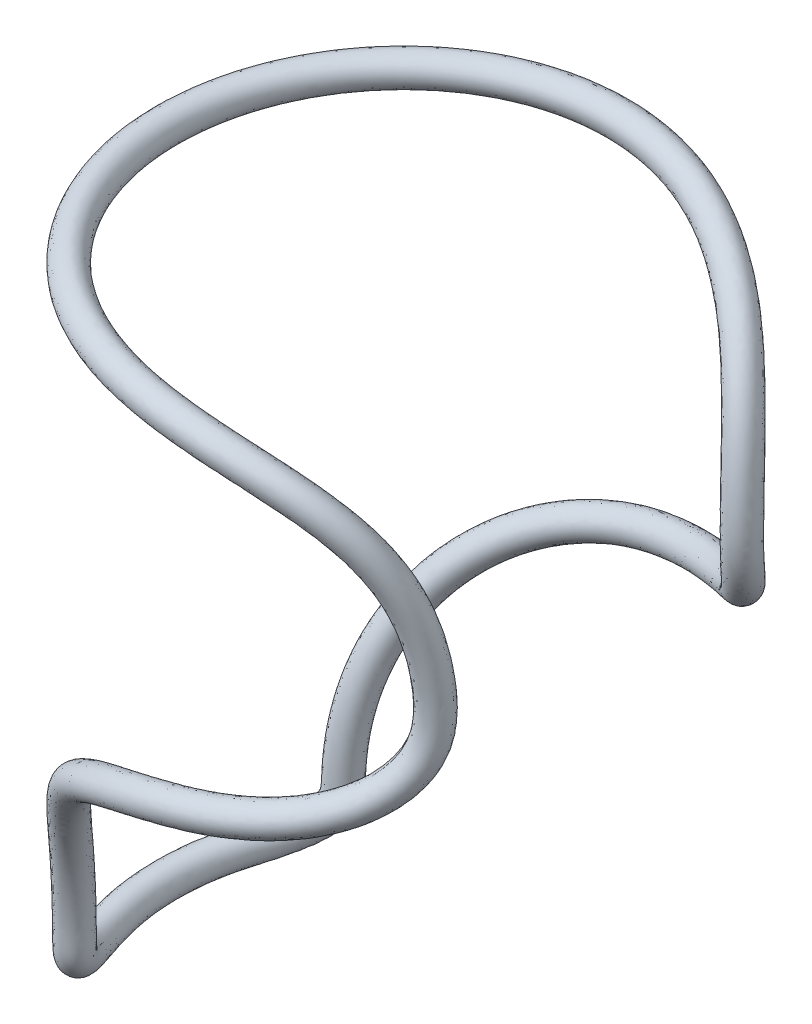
ISO-10303-21;
HEADER;
FILE_DESCRIPTION(('STEP AP214'),'2;1');
FILE_NAME('part.step','',(''),(''),'','','');
FILE_SCHEMA(('AUTOMOTIVE_DESIGN { 1 0 10303 214 1 1 1 1 }'));
ENDSEC;
DATA;
#1=APPLICATION_CONTEXT('core data for automotive mechanical design processes');
#2=APPLICATION_PROTOCOL_DEFINITION('international standard','automotive_design',2000,#1);
#3=PRODUCT_CONTEXT('',#1,'mechanical');
#4=PRODUCT('Part','Part','',(#3));
#5=PRODUCT_RELATED_PRODUCT_CATEGORY('part','',(#4));
#6=PRODUCT_DEFINITION_FORMATION('','',#4);
#7=PRODUCT_DEFINITION_CONTEXT('part definition',#1,'design');
#8=PRODUCT_DEFINITION('design','',#6,#7);
#9=PRODUCT_DEFINITION_SHAPE('','',#8);
#10=(LENGTH_UNIT() NAMED_UNIT(*) SI_UNIT(.MILLI.,.METRE.));
#11=(NAMED_UNIT(*) PLANE_ANGLE_UNIT() SI_UNIT($,.RADIAN.));
#12=(NAMED_UNIT(*) SI_UNIT($,.STERADIAN.) SOLID_ANGLE_UNIT());
#13=UNCERTAINTY_MEASURE_WITH_UNIT(LENGTH_MEASURE(1.E-05),#10,'distance_accuracy_value','');
#14=(GEOMETRIC_REPRESENTATION_CONTEXT(3) GLOBAL_UNCERTAINTY_ASSIGNED_CONTEXT((#13)) GLOBAL_UNIT_ASSIGNED_CONTEXT((#10,
#11,#12)) REPRESENTATION_CONTEXT('',''));
#15=CARTESIAN_POINT('',(0.,0.,0.));
#16=DIRECTION('',(0.,0.,1.));
#17=DIRECTION('',(1.,0.,0.));
#18=AXIS2_PLACEMENT_3D('',#15,#16,#17);
#19=CARTESIAN_POINT('',(-36.2610998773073,0.114162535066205,-14.0125693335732));
#20=CARTESIAN_POINT('',(-35.8052109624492,0.216388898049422,-15.1922948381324));
#21=CARTESIAN_POINT('',(-35.2963819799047,0.400187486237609,-16.3393761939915));
#22=CARTESIAN_POINT('',(-34.254794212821,1.01154928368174,-18.4117113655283));
#23=CARTESIAN_POINT('',(-33.7419733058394,1.40521992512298,-19.3240000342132));
#24=CARTESIAN_POINT('',(-33.1601649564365,2.15334157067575,-20.2854760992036));
#25=CARTESIAN_POINT('',(-33.0458033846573,2.31582527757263,-20.4700950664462));
#26=CARTESIAN_POINT('',(-32.8340175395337,2.66460621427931,-20.8063593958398));
#27=CARTESIAN_POINT('',(-32.7361507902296,2.85184522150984,-20.958886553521));
#28=CARTESIAN_POINT('',(-32.5646110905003,3.25509340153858,-21.2233578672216));
#29=CARTESIAN_POINT('',(-32.4903138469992,3.47102174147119,-21.336205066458));
#30=CARTESIAN_POINT('',(-32.3759562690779,3.9337577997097,-21.5091143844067));
#31=CARTESIAN_POINT('',(-32.3341760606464,4.18938426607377,-21.5718051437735));
#32=CARTESIAN_POINT('',(-32.2733677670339,4.73106184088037,-21.6623016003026));
#33=CARTESIAN_POINT('',(-32.2543381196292,5.01698299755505,-21.6901096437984));
#34=CARTESIAN_POINT('',(-32.235957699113,5.45381412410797,-21.7164806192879));
#35=CARTESIAN_POINT('',(-32.2313785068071,5.60152985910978,-21.7229372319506));
#36=CARTESIAN_POINT('',(-32.2232119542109,5.8943273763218,-21.7343955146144));
#37=CARTESIAN_POINT('',(-32.2198260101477,6.04005519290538,-21.7390894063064));
#38=CARTESIAN_POINT('',(-32.2107722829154,6.47425634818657,-21.7515658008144));
#39=CARTESIAN_POINT('',(-32.2062134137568,6.75973965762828,-21.7577354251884));
#40=CARTESIAN_POINT('',(-32.1975796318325,7.17822542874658,-21.76985974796));
#41=CARTESIAN_POINT('',(-32.194305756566,7.31621019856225,-21.7745295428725));
#42=CARTESIAN_POINT('',(-32.1869191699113,7.58755761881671,-21.7851766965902));
#43=CARTESIAN_POINT('',(-32.1829996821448,7.72212102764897,-21.7908498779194));
#44=CARTESIAN_POINT('',(-32.1454731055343,8.9259043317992,-21.8452914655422));
#45=CARTESIAN_POINT('',(-32.094632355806,9.96797091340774,-21.9194881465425));
#46=CARTESIAN_POINT('',(-31.8758387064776,13.1065543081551,-22.2345881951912));
#47=CARTESIAN_POINT('',(-31.6447930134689,15.1726717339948,-22.5626867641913));
#48=CARTESIAN_POINT('',(-30.9575547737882,19.2576634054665,-23.4824544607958));
#49=CARTESIAN_POINT('',(-30.4996226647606,21.279755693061,-24.0742995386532));
#50=CARTESIAN_POINT('',(-29.237201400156,25.4398801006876,-25.5669080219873));
#51=CARTESIAN_POINT('',(-28.3961056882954,27.5519811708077,-26.4971736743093));
#52=CARTESIAN_POINT('',(-26.2797801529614,31.582260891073,-28.544150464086));
#53=CARTESIAN_POINT('',(-25.0112358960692,33.4736248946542,-29.6501319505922));
#54=CARTESIAN_POINT('',(-22.0667793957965,36.9171167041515,-31.8348506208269));
#55=CARTESIAN_POINT('',(-20.3684979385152,38.4945727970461,-32.9286445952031));
#56=CARTESIAN_POINT('',(-16.5809669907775,41.3094679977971,-34.9175265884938));
#57=CARTESIAN_POINT('',(-14.5305140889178,42.5250673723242,-35.7954294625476));
#58=CARTESIAN_POINT('',(-10.119313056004,44.6753975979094,-37.2180971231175));
#59=CARTESIAN_POINT('',(-7.75675901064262,45.6062674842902,-37.7578438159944));
#60=CARTESIAN_POINT('',(-2.94743221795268,47.2053355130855,-38.3794754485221));
#61=CARTESIAN_POINT('',(-0.498254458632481,47.8712982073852,-38.4672037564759));
#62=CARTESIAN_POINT('',(4.42458138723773,49.0810823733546,-38.1701443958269));
#63=CARTESIAN_POINT('',(6.86661601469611,49.631996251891,-37.7823828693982));
#64=CARTESIAN_POINT('',(11.5302719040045,50.8151746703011,-36.5806832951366));
#65=CARTESIAN_POINT('',(13.7711603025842,51.4486917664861,-35.7634098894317));
#66=CARTESIAN_POINT('',(17.9769182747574,52.9861360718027,-33.7761307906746));
#67=CARTESIAN_POINT('',(19.8926103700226,53.8663075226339,-32.6244706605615));
#68=CARTESIAN_POINT('',(23.2730360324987,56.0849567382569,-30.1928251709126));
#69=CARTESIAN_POINT('',(24.7004822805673,57.3976609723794,-28.9269094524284));
#70=CARTESIAN_POINT('',(26.2629155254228,59.8041448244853,-27.3752850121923));
#71=CARTESIAN_POINT('',(26.6750171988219,60.6639539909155,-26.9303190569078));
#72=CARTESIAN_POINT('',(27.1154307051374,61.995603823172,-26.4404858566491));
#73=CARTESIAN_POINT('',(27.2359352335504,62.4620194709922,-26.3030870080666));
#74=CARTESIAN_POINT('',(27.4305125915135,63.4335829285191,-26.0784225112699));
#75=CARTESIAN_POINT('',(27.5025685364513,63.9275077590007,-25.9933438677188));
#76=CARTESIAN_POINT('',(27.6024528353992,64.946593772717,-25.8760253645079));
#77=CARTESIAN_POINT('',(27.634238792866,65.4819225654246,-25.8386348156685));
#78=CARTESIAN_POINT('',(27.6626110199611,66.5563153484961,-25.8051862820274));
#79=CARTESIAN_POINT('',(27.6599263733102,67.1029529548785,-25.8082723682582));
#80=CARTESIAN_POINT('',(27.610442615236,68.7648928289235,-25.8663388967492));
#81=CARTESIAN_POINT('',(27.5211329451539,69.909520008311,-25.9714012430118));
#82=CARTESIAN_POINT('',(27.2921518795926,72.1876152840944,-26.242022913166));
#83=CARTESIAN_POINT('',(27.1453977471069,73.3045843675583,-26.4146770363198));
#84=CARTESIAN_POINT('',(26.7693216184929,75.5196421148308,-26.8391424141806));
#85=CARTESIAN_POINT('',(26.5402951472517,76.6120247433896,-27.0905402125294));
#86=CARTESIAN_POINT('',(25.7145970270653,79.7996685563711,-27.9563392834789));
#87=CARTESIAN_POINT('',(24.9739297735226,81.8264400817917,-28.6983887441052));
#88=CARTESIAN_POINT('',(22.9930803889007,85.5573335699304,-30.4363729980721));
#89=CARTESIAN_POINT('',(21.7640515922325,87.2415227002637,-31.4158526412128));
#90=CARTESIAN_POINT('',(18.7649102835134,90.2160175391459,-33.4076423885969));
#91=CARTESIAN_POINT('',(16.9965601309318,91.5011767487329,-34.4106083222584));
#92=CARTESIAN_POINT('',(13.0994401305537,93.6539856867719,-36.1539138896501));
#93=CARTESIAN_POINT('',(10.9376585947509,94.5447472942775,-36.9090444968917));
#94=CARTESIAN_POINT('',(6.35756001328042,95.9927734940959,-38.0191146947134));
#95=CARTESIAN_POINT('',(3.98478222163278,96.5392133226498,-38.363631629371));
#96=CARTESIAN_POINT('',(-0.898655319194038,97.4049802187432,-38.5873588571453));
#97=CARTESIAN_POINT('',(-3.42207682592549,97.723318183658,-38.4591565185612));
#98=CARTESIAN_POINT('',(-8.35401993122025,98.1953630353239,-37.7120334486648));
#99=CARTESIAN_POINT('',(-10.7802881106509,98.353695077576,-37.0993144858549));
#100=CARTESIAN_POINT('',(-15.5390523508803,98.5852650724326,-35.3776477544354));
#101=CARTESIAN_POINT('',(-17.842121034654,98.6560833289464,-34.2761960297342));
#102=CARTESIAN_POINT('',(-22.1560264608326,98.7525566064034,-31.6636419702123));
#103=CARTESIAN_POINT('',(-24.1953665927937,98.778238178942,-30.1367679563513));
#104=CARTESIAN_POINT('',(-27.9504792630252,98.8110706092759,-26.6913899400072));
#105=CARTESIAN_POINT('',(-29.6427407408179,98.8176418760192,-24.7986710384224));
#106=CARTESIAN_POINT('',(-32.6320037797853,98.8253271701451,-20.7087355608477));
#107=CARTESIAN_POINT('',(-33.9385675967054,98.8261333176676,-18.4902869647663));
#108=CARTESIAN_POINT('',(-37.1411405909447,98.8273393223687,-11.5621518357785));
#109=CARTESIAN_POINT('',(-38.3452935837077,98.8268082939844,-6.55779259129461));
#110=CARTESIAN_POINT('',(-38.6319950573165,98.826765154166,1.13295250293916));
#111=CARTESIAN_POINT('',(-38.4713870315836,98.8267693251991,3.70279481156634));
#112=CARTESIAN_POINT('',(-37.6488623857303,98.826794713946,8.73659286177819));
#113=CARTESIAN_POINT('',(-36.9938122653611,98.8268662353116,11.1851133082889));
#114=CARTESIAN_POINT('',(-35.2182839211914,98.8266815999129,15.915514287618));
#115=CARTESIAN_POINT('',(-34.0838266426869,98.8264652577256,18.2203200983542));
#116=CARTESIAN_POINT('',(-31.4010065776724,98.8227414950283,22.532217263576));
#117=CARTESIAN_POINT('',(-29.8654211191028,98.8192355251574,24.5308630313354));
#118=CARTESIAN_POINT('',(-26.3909894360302,98.7994739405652,28.232563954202));
#119=CARTESIAN_POINT('',(-24.4599716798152,98.782975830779,29.9206394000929));
#120=CARTESIAN_POINT('',(-20.3483733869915,98.7173608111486,32.8535246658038));
#121=CARTESIAN_POINT('',(-18.1561884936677,98.6682055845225,34.1119493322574));
#122=CARTESIAN_POINT('',(-13.5261429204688,98.4984975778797,36.1926157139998));
#123=CARTESIAN_POINT('',(-11.1283374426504,98.3794137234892,36.9953866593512));
#124=CARTESIAN_POINT('',(-6.24561036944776,98.0146111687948,38.1128497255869));
#125=CARTESIAN_POINT('',(-3.74074031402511,97.7671918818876,38.4292200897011));
#126=CARTESIAN_POINT('',(1.22393019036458,97.0660149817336,38.5703531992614));
#127=CARTESIAN_POINT('',(3.6667869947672,96.6158106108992,38.3950935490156));
#128=CARTESIAN_POINT('',(8.41758838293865,95.4037242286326,37.5992905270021));
#129=CARTESIAN_POINT('',(10.6801937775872,94.6518784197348,36.9830099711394));
#130=CARTESIAN_POINT('',(14.885545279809,92.7614420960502,35.4291569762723));
#131=CARTESIAN_POINT('',(16.8274806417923,91.6224657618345,34.4873958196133));
#132=CARTESIAN_POINT('',(20.1913149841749,88.9497956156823,32.5236648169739));
#133=CARTESIAN_POINT('',(21.6451387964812,87.3816337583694,31.486429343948));
#134=CARTESIAN_POINT('',(23.9751796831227,83.9261886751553,29.618206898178));
#135=CARTESIAN_POINT('',(24.8947864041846,81.9864655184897,28.7576391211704));
#136=CARTESIAN_POINT('',(26.285655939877,77.8949685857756,27.3717343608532));
#137=CARTESIAN_POINT('',(26.767030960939,75.736258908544,26.8362340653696));
#138=CARTESIAN_POINT('',(27.2685619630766,72.3785559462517,26.2676966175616));
#139=CARTESIAN_POINT('',(27.3978827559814,71.2405385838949,26.1165523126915));
#140=CARTESIAN_POINT('',(27.5901284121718,68.9638414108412,25.890627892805));
#141=CARTESIAN_POINT('',(27.6500154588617,67.8512563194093,25.8189429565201));
#142=CARTESIAN_POINT('',(27.6539768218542,65.6503592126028,25.8143978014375));
#143=CARTESIAN_POINT('',(27.5958215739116,64.5633218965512,25.8845593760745));
#144=CARTESIAN_POINT('',(27.3002158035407,62.6109630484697,26.2303174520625));
#145=CARTESIAN_POINT('',(27.0474164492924,61.6628723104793,26.5229180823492));
#146=CARTESIAN_POINT('',(25.9571039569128,59.0365853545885,27.7027765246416));
#147=CARTESIAN_POINT('',(24.7637653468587,57.4950125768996,28.9003314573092));
#148=CARTESIAN_POINT('',(21.7385929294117,54.9349948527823,31.3628025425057));
#149=CARTESIAN_POINT('',(19.9437629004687,53.9130532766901,32.6045359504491));
#150=CARTESIAN_POINT('',(15.9596489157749,52.1781787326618,34.8075828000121));
#151=CARTESIAN_POINT('',(13.7609080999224,51.4613148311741,35.7733526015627));
#152=CARTESIAN_POINT('',(9.18767639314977,50.1909583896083,37.2633175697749));
#153=CARTESIAN_POINT('',(6.79921019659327,49.632104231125,37.7999894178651));
#154=CARTESIAN_POINT('',(1.86977007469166,48.461805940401,38.4040612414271));
#155=CARTESIAN_POINT('',(-0.639240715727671,47.8499540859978,38.4664792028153));
#156=CARTESIAN_POINT('',(-5.55752663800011,46.3815890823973,38.1203287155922));
#157=CARTESIAN_POINT('',(-7.99006623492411,45.5291818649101,37.7096920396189));
#158=CARTESIAN_POINT('',(-12.6090194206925,43.5315683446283,36.490870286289));
#159=CARTESIAN_POINT('',(-14.7774965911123,42.3960500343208,35.6919295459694));
#160=CARTESIAN_POINT('',(-18.8078509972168,39.7543255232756,33.8175063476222));
#161=CARTESIAN_POINT('',(-20.6461891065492,38.2557582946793,32.7494208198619));
#162=CARTESIAN_POINT('',(-23.8558393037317,34.9579098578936,30.5661690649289));
#163=CARTESIAN_POINT('',(-25.2455557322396,33.1451682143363,29.4428919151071));
#164=CARTESIAN_POINT('',(-27.6154281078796,29.2125368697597,27.2968583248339));
#165=CARTESIAN_POINT('',(-28.5754073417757,27.1219143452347,26.2933093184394));
#166=CARTESIAN_POINT('',(-29.9740488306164,23.1649403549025,24.713806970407));
#167=CARTESIAN_POINT('',(-30.4829501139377,21.3063539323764,24.0866110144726));
#168=CARTESIAN_POINT('',(-31.2864730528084,17.5188233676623,23.0516062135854));
#169=CARTESIAN_POINT('',(-31.579846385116,15.6006234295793,22.6506319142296));
#170=CARTESIAN_POINT('',(-31.8938052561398,12.6981904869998,22.2133527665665));
#171=CARTESIAN_POINT('',(-31.9772646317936,11.7243886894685,22.0944705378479));
#172=CARTESIAN_POINT('',(-32.1061923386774,9.77600635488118,21.907926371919));
#173=CARTESIAN_POINT('',(-32.151082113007,8.81079054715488,21.8408118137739));
#174=CARTESIAN_POINT('',(-32.1963452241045,7.30623727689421,21.7732753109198));
#175=CARTESIAN_POINT('',(-32.2048182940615,6.78877839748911,21.7608257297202));
#176=CARTESIAN_POINT('',(-32.2196793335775,5.9799202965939,21.7398452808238));
#177=CARTESIAN_POINT('',(-32.2257235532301,5.70664746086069,21.7313154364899));
#178=CARTESIAN_POINT('',(-32.2398907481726,5.2950908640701,21.710956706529));
#179=CARTESIAN_POINT('',(-32.2456402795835,5.15959787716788,21.7026421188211));
#180=CARTESIAN_POINT('',(-32.2611038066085,4.89191477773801,21.6800226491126));
#181=CARTESIAN_POINT('',(-32.270674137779,4.75994973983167,21.6659325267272));
#182=CARTESIAN_POINT('',(-32.3062327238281,4.37264916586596,21.6132191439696));
#183=CARTESIAN_POINT('',(-32.3391046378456,4.12596727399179,21.5640957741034));
#184=CARTESIAN_POINT('',(-32.4070207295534,3.78465583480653,21.4617500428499));
#185=CARTESIAN_POINT('',(-32.4327508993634,3.67566107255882,21.4228734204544));
#186=CARTESIAN_POINT('',(-32.4911485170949,3.46882066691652,21.3344038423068));
#187=CARTESIAN_POINT('',(-32.5245716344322,3.36646767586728,21.2836230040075));
#188=CARTESIAN_POINT('',(-32.7043000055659,2.87636329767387,21.0089873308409));
#189=CARTESIAN_POINT('',(-32.8952803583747,2.53681276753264,20.7129237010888));
#190=CARTESIAN_POINT('',(-33.3502056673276,1.88675741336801,19.9769928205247));
#191=CARTESIAN_POINT('',(-33.6100612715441,1.59902431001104,19.5384059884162));
#192=CARTESIAN_POINT('',(-34.137092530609,1.12088992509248,18.6036359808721));
#193=CARTESIAN_POINT('',(-34.4038383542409,0.926580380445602,18.1066305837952));
#194=CARTESIAN_POINT('',(-35.1835779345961,0.451418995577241,16.5718131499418));
#195=CARTESIAN_POINT('',(-35.6770966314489,0.27033216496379,15.4856953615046));
#196=CARTESIAN_POINT('',(-36.5540737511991,0.0464462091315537,13.2822624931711));
#197=CARTESIAN_POINT('',(-36.9439644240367,0.00844904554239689,12.1557269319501));
#198=CARTESIAN_POINT('',(-37.6195392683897,-0.0156591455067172,9.8706241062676));
#199=CARTESIAN_POINT('',(-37.9048329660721,-0.00757213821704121,8.7127805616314));
#200=CARTESIAN_POINT('',(-39.05988315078,-0.00784140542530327,2.87073087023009));
#201=CARTESIAN_POINT('',(-39.1159912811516,-0.00758255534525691,-1.98196283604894));
#202=CARTESIAN_POINT('',(-38.0787256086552,-0.00758335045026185,-7.93040327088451));
#203=CARTESIAN_POINT('',(-37.79977500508,-0.00881385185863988,-9.1686015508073));
#204=CARTESIAN_POINT('',(-37.1184780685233,-0.00514212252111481,-11.6223146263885));
#205=CARTESIAN_POINT('',(-36.7169887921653,0.0119361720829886,-12.832843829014));
#206=CARTESIAN_POINT('',(-36.2610998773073,0.114162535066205,-14.0125693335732));
#207=CARTESIAN_POINT('',(-36.3990409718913,4.8487220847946,-13.6556125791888));
#208=CARTESIAN_POINT('',(-36.0184614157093,4.93406143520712,-14.6404564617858));
#209=CARTESIAN_POINT('',(-35.6170202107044,5.08468408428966,-15.5360677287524));
#210=CARTESIAN_POINT('',(-34.8691348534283,5.52365602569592,-17.0240529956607));
#211=CARTESIAN_POINT('',(-34.5988587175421,5.76455353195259,-17.4881920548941));
#212=CARTESIAN_POINT('',(-34.4148864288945,6.00100193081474,-17.7919260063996));
#213=CARTESIAN_POINT('',(-34.3834764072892,6.04833647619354,-17.8421419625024));
#214=CARTESIAN_POINT('',(-34.3752489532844,6.06173869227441,-17.8548779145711));
#215=CARTESIAN_POINT('',(-34.3905959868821,6.03826302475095,-17.8305316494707));
#216=CARTESIAN_POINT('',(-34.4457824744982,5.90829450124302,-17.7450293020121));
#217=CARTESIAN_POINT('',(-34.482729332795,5.81294374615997,-17.6885655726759));
#218=CARTESIAN_POINT('',(-34.5686190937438,5.465380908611,-17.558677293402));
#219=CARTESIAN_POINT('',(-34.5751466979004,5.38488676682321,-17.5490749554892));
#220=CARTESIAN_POINT('',(-34.5730009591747,5.40400075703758,-17.5522682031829));
#221=CARTESIAN_POINT('',(-34.5641052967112,5.49940457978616,-17.5654041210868));
#222=CARTESIAN_POINT('',(-34.5542707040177,5.73303512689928,-17.5795042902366));
#223=CARTESIAN_POINT('',(-34.5503221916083,5.85432805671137,-17.5850903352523));
#224=CARTESIAN_POINT('',(-34.5436112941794,6.0948910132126,-17.5945036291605));
#225=CARTESIAN_POINT('',(-34.5406634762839,6.22079302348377,-17.5985911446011));
#226=CARTESIAN_POINT('',(-34.5324451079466,6.61493089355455,-17.6099163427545));
#227=CARTESIAN_POINT('',(-34.5279035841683,6.89937021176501,-17.6160502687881));
#228=CARTESIAN_POINT('',(-34.51839563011,7.36019900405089,-17.6294010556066));
#229=CARTESIAN_POINT('',(-34.5143293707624,7.53086314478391,-17.6352018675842));
#230=CARTESIAN_POINT('',(-34.5063491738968,7.82400873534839,-17.6467042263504));
#231=CARTESIAN_POINT('',(-34.5021007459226,7.96987946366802,-17.652852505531));
#232=CARTESIAN_POINT('',(-34.4612996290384,9.27855445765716,-17.7120355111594));
#233=CARTESIAN_POINT('',(-34.4052565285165,10.4313554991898,-17.7938210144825));
#234=CARTESIAN_POINT('',(-34.1633853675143,13.900715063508,-18.1421203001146));
#235=CARTESIAN_POINT('',(-33.9066352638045,16.202706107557,-18.5068188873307));
#236=CARTESIAN_POINT('',(-33.1370892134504,20.7765522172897,-19.5366247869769));
#237=CARTESIAN_POINT('',(-32.6257943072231,23.0337476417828,-20.1973618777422));
#238=CARTESIAN_POINT('',(-31.2130511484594,27.6892354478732,-21.8677013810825));
#239=CARTESIAN_POINT('',(-30.2755374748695,30.0391463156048,-22.9036995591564));
#240=CARTESIAN_POINT('',(-27.936761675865,34.4930543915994,-25.1658369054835));
#241=CARTESIAN_POINT('',(-26.5477343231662,36.5590850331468,-26.3751442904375));
#242=CARTESIAN_POINT('',(-23.3578741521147,40.2895719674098,-28.741946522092));
#243=CARTESIAN_POINT('',(-21.5437250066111,41.9687950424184,-29.9072548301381));
#244=CARTESIAN_POINT('',(-17.5595352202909,44.9298470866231,-31.9994047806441));
#245=CARTESIAN_POINT('',(-15.4345803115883,46.1849837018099,-32.9054130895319));
#246=CARTESIAN_POINT('',(-10.9458149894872,48.3731240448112,-34.3530959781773));
#247=CARTESIAN_POINT('',(-8.58082681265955,49.3022527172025,-34.8900677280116));
#248=CARTESIAN_POINT('',(-3.83208389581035,50.8811768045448,-35.503868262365));
#249=CARTESIAN_POINT('',(-1.44171770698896,51.5291843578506,-35.5848469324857));
#250=CARTESIAN_POINT('',(3.23791416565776,52.6792011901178,-35.3024632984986));
#251=CARTESIAN_POINT('',(5.49039651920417,53.1872438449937,-34.9384675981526));
#252=CARTESIAN_POINT('',(9.69674060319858,54.2544011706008,-33.8546046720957));
#253=CARTESIAN_POINT('',(11.6775972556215,54.81637321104,-33.1278373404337));
#254=CARTESIAN_POINT('',(15.3190384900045,56.1475273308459,-31.4072052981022));
#255=CARTESIAN_POINT('',(16.9271879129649,56.8921556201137,-30.4346868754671));
#256=CARTESIAN_POINT('',(19.6960855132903,58.7094448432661,-28.4429317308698));
#257=CARTESIAN_POINT('',(20.8062495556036,59.7529548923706,-27.4503169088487));
#258=CARTESIAN_POINT('',(21.9557620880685,61.5234512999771,-26.3087557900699));
#259=CARTESIAN_POINT('',(22.2487130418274,62.1452483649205,-25.9912436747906));
#260=CARTESIAN_POINT('',(22.5445197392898,63.0396578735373,-25.6622434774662));
#261=CARTESIAN_POINT('',(22.6280066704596,63.3604036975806,-25.566998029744));
#262=CARTESIAN_POINT('',(22.7691980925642,64.0654005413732,-25.4039742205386));
#263=CARTESIAN_POINT('',(22.8226318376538,64.4250919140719,-25.340804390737));
#264=CARTESIAN_POINT('',(22.900665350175,65.2212467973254,-25.2491504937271));
#265=CARTESIAN_POINT('',(22.9281701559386,65.6712730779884,-25.2167980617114));
#266=CARTESIAN_POINT('',(22.952090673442,66.5770865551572,-25.1885963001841));
#267=CARTESIAN_POINT('',(22.9500781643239,67.0492086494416,-25.1909016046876));
#268=CARTESIAN_POINT('',(22.9063809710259,68.5168092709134,-25.2421757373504));
#269=CARTESIAN_POINT('',(22.8244178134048,69.5815590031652,-25.3385890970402));
#270=CARTESIAN_POINT('',(22.6089696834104,71.7250189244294,-25.5932168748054));
#271=CARTESIAN_POINT('',(22.4744968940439,72.7429308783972,-25.7513923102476));
#272=CARTESIAN_POINT('',(22.1316657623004,74.7621451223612,-26.1383838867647));
#273=CARTESIAN_POINT('',(21.924749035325,75.7465780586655,-26.365432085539));
#274=CARTESIAN_POINT('',(21.1897619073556,78.5840280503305,-27.1361148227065));
#275=CARTESIAN_POINT('',(20.5421550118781,80.3387998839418,-27.7832925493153));
#276=CARTESIAN_POINT('',(18.8723389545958,83.483867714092,-29.2483785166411));
#277=CARTESIAN_POINT('',(17.852911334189,84.8737934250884,-30.05935743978));
#278=CARTESIAN_POINT('',(15.3998136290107,87.3067319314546,-31.6885091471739));
#279=CARTESIAN_POINT('',(13.932340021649,88.3757295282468,-32.5222050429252));
#280=CARTESIAN_POINT('',(10.6901874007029,90.1667275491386,-33.9725232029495));
#281=CARTESIAN_POINT('',(8.85578331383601,90.9257428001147,-34.6162213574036));
#282=CARTESIAN_POINT('',(4.93504261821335,92.1653087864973,-35.5664843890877));
#283=CARTESIAN_POINT('',(2.87782240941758,92.6408619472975,-35.8680450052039));
#284=CARTESIAN_POINT('',(-1.42217192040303,93.4031922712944,-36.0650429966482));
#285=CARTESIAN_POINT('',(-3.67793953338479,93.6888094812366,-35.9531620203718));
#286=CARTESIAN_POINT('',(-8.12671966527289,94.1146098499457,-35.2792316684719));
#287=CARTESIAN_POINT('',(-10.3390664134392,94.2594608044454,-34.7228646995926));
#288=CARTESIAN_POINT('',(-14.7107740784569,94.4721958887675,-33.1412307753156));
#289=CARTESIAN_POINT('',(-16.8417609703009,94.5378433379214,-32.1233990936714));
#290=CARTESIAN_POINT('',(-20.8465785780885,94.6274043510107,-29.6980324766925));
#291=CARTESIAN_POINT('',(-22.7481433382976,94.651385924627,-28.2754528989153));
#292=CARTESIAN_POINT('',(-26.2595076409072,94.6820871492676,-25.0537180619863));
#293=CARTESIAN_POINT('',(-27.8453217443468,94.6882438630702,-23.2804153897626));
#294=CARTESIAN_POINT('',(-30.6470819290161,94.6954470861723,-19.4470230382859));
#295=CARTESIAN_POINT('',(-31.874515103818,94.6962031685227,-17.3632077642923));
#296=CARTESIAN_POINT('',(-34.8802846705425,94.6973350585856,-10.8608179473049));
#297=CARTESIAN_POINT('',(-36.0120597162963,94.69683608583,-6.15945561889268));
#298=CARTESIAN_POINT('',(-36.2813735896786,94.6967955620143,1.06486776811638));
#299=CARTESIAN_POINT('',(-36.1305343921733,94.696799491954,3.47807675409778));
#300=CARTESIAN_POINT('',(-35.3582243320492,94.6968233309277,8.20456455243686));
#301=CARTESIAN_POINT('',(-34.7426404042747,94.6968907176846,10.5054001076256));
#302=CARTESIAN_POINT('',(-33.0759512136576,94.6967174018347,14.9458295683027));
#303=CARTESIAN_POINT('',(-32.0102041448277,94.696515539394,17.1109852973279));
#304=CARTESIAN_POINT('',(-29.4928263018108,94.6930214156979,21.1569793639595));
#305=CARTESIAN_POINT('',(-28.0536668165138,94.6897379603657,23.0297414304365));
#306=CARTESIAN_POINT('',(-24.8002313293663,94.6712333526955,26.4959904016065));
#307=CARTESIAN_POINT('',(-22.994584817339,94.6557887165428,28.0735535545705));
#308=CARTESIAN_POINT('',(-19.1661891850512,94.5946932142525,30.8044245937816));
#309=CARTESIAN_POINT('',(-17.1327078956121,94.5490401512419,31.9707126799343));
#310=CARTESIAN_POINT('',(-12.8554059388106,94.3922615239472,33.8928618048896));
#311=CARTESIAN_POINT('',(-10.6564580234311,94.2827278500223,34.6269275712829));
#312=CARTESIAN_POINT('',(-6.21969837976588,93.9512448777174,35.6423262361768));
#313=CARTESIAN_POINT('',(-3.96125537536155,93.7274259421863,35.9251552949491));
#314=CARTESIAN_POINT('',(0.457054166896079,93.1034135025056,36.0507565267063));
#315=CARTESIAN_POINT('',(2.59897080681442,92.7070989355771,35.8940408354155));
#316=CARTESIAN_POINT('',(6.71239692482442,91.6576282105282,35.2050038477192));
#317=CARTESIAN_POINT('',(8.6394831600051,91.0146788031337,34.6770112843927));
#318=CARTESIAN_POINT('',(12.1779065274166,89.4240476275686,33.3695840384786));
#319=CARTESIAN_POINT('',(13.8056811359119,88.4653594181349,32.5775828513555));
#320=CARTESIAN_POINT('',(16.5594743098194,86.2773861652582,30.9699798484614));
#321=CARTESIAN_POINT('',(17.7649083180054,84.9787286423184,30.1104297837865));
#322=CARTESIAN_POINT('',(19.6855194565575,82.1304667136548,28.570486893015));
#323=CARTESIAN_POINT('',(20.4777841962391,80.4766829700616,27.8316949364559));
#324=CARTESIAN_POINT('',(21.6907638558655,76.9084813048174,26.6230447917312));
#325=CARTESIAN_POINT('',(22.127532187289,74.9717399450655,26.1381555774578));
#326=CARTESIAN_POINT('',(22.5886161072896,71.8848267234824,25.6154690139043));
#327=CARTESIAN_POINT('',(22.7086587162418,70.830330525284,25.4751682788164));
#328=CARTESIAN_POINT('',(22.887969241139,68.7068197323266,25.2644450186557));
#329=CARTESIAN_POINT('',(22.9405372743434,67.7055086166,25.2014741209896));
#330=CARTESIAN_POINT('',(22.9439998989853,65.7817023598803,25.1975012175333));
#331=CARTESIAN_POINT('',(22.8890215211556,64.8801788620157,25.2635720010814));
#332=CARTESIAN_POINT('',(22.6755110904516,63.4700228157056,25.5133068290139));
#333=CARTESIAN_POINT('',(22.498081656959,62.8130568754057,25.7187570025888));
#334=CARTESIAN_POINT('',(21.7496563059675,61.0102921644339,26.5286503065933));
#335=CARTESIAN_POINT('',(20.8588969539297,59.8164033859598,27.431098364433));
#336=CARTESIAN_POINT('',(18.4596741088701,57.7860893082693,29.384051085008));
#337=CARTESIAN_POINT('',(16.9734995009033,56.9294091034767,30.4191159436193));
#338=CARTESIAN_POINT('',(13.5890366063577,55.4556516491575,32.2905814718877));
#339=CARTESIAN_POINT('',(11.6683578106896,54.8260503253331,33.1393059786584));
#340=CARTESIAN_POINT('',(7.60169911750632,53.6964104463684,34.4642290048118));
#341=CARTESIAN_POINT('',(5.4298602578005,53.1873671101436,34.9580291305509));
#342=CARTESIAN_POINT('',(0.830893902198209,52.0955267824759,35.5216036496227));
#343=CARTESIAN_POINT('',(-1.58389568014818,51.5082443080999,35.5872753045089));
#344=CARTESIAN_POINT('',(-6.40145373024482,50.0699520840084,35.2482144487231));
#345=CARTESIAN_POINT('',(-8.81159654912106,49.2276393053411,34.8444898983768));
#346=CARTESIAN_POINT('',(-13.4654560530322,47.214929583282,33.6164574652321));
#347=CARTESIAN_POINT('',(-15.6903686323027,46.0542405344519,32.8007762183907));
#348=CARTESIAN_POINT('',(-19.8912134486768,43.3007670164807,30.8470621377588));
#349=CARTESIAN_POINT('',(-21.8387425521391,41.7189733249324,29.7190285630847));
#350=CARTESIAN_POINT('',(-25.2902204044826,38.1726523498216,27.3712823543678));
#351=CARTESIAN_POINT('',(-26.8025196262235,36.2056371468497,26.1511087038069));
#352=CARTESIAN_POINT('',(-29.4088707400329,31.8805867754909,23.7909325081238));
#353=CARTESIAN_POINT('',(-30.4743995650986,29.5659760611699,22.6783926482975));
#354=CARTESIAN_POINT('',(-32.0375970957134,25.1434477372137,20.9130554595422));
#355=CARTESIAN_POINT('',(-32.6060030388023,23.0684982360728,20.2126966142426));
#356=CARTESIAN_POINT('',(-33.5054629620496,18.8288499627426,19.0541528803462));
#357=CARTESIAN_POINT('',(-33.8342227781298,16.6777974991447,18.6048445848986));
#358=CARTESIAN_POINT('',(-34.1832838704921,13.450857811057,18.1186754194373));
#359=CARTESIAN_POINT('',(-34.2757464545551,12.3709326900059,17.986969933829));
#360=CARTESIAN_POINT('',(-34.4178938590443,10.2229100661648,17.7813161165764));
#361=CARTESIAN_POINT('',(-34.4674201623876,9.15585680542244,17.7072839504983));
#362=CARTESIAN_POINT('',(-34.5167300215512,7.51695635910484,17.633719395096));
#363=CARTESIAN_POINT('',(-34.5271369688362,6.89781679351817,17.6184672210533));
#364=CARTESIAN_POINT('',(-34.5408733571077,6.15054464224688,17.5990884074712));
#365=CARTESIAN_POINT('',(-34.5461122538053,5.92230821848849,17.5916861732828));
#366=CARTESIAN_POINT('',(-34.5567305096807,5.61387637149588,17.5764294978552));
#367=CARTESIAN_POINT('',(-34.5592886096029,5.55966881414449,17.5727231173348));
#368=CARTESIAN_POINT('',(-34.5653097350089,5.45552413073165,17.5639279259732));
#369=CARTESIAN_POINT('',(-34.5682895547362,5.41804283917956,17.5595285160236));
#370=CARTESIAN_POINT('',(-34.573863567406,5.35741624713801,17.5512871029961));
#371=CARTESIAN_POINT('',(-34.5741256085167,5.38788329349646,17.550761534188));
#372=CARTESIAN_POINT('',(-34.5399672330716,5.55955187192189,17.6022411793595));
#373=CARTESIAN_POINT('',(-34.522511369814,5.63749389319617,17.6285965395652));
#374=CARTESIAN_POINT('',(-34.4686299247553,5.82833964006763,17.7102265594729));
#375=CARTESIAN_POINT('',(-34.4569258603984,5.85994043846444,17.7281923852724));
#376=CARTESIAN_POINT('',(-34.372948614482,6.08917090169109,17.8568834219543));
#377=CARTESIAN_POINT('',(-34.3408018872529,6.10818100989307,17.9104510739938));
#378=CARTESIAN_POINT('',(-34.4623561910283,5.93449110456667,17.7138153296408));
#379=CARTESIAN_POINT('',(-34.5638473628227,5.8143456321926,17.5451721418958));
#380=CARTESIAN_POINT('',(-34.8231388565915,5.57918510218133,17.0855557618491));
#381=CARTESIAN_POINT('',(-34.9924947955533,5.45164117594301,16.7725667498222));
#382=CARTESIAN_POINT('',(-35.5106869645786,5.13592883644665,15.7529486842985));
#383=CARTESIAN_POINT('',(-35.9095021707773,4.98077174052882,14.8863479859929));
#384=CARTESIAN_POINT('',(-36.6412851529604,4.79397972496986,13.0481891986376));
#385=CARTESIAN_POINT('',(-36.9907024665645,4.75749608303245,12.0483917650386));
#386=CARTESIAN_POINT('',(-37.6276798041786,4.73476547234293,9.89413439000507));
#387=CARTESIAN_POINT('',(-37.9197026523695,4.7424036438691,8.7157872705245));
#388=CARTESIAN_POINT('',(-39.0750254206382,4.74213430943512,2.87236555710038));
#389=CARTESIAN_POINT('',(-39.132249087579,4.74239323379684,-1.97701687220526));
#390=CARTESIAN_POINT('',(-38.0933153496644,4.74239243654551,-7.93502229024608));
#391=CARTESIAN_POINT('',(-37.8102234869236,4.74118914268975,-9.18728001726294));
#392=CARTESIAN_POINT('',(-37.1407219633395,4.74479724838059,-11.5985115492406));
#393=CARTESIAN_POINT('',(-36.7796205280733,4.76338273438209,-12.6707686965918));
#394=CARTESIAN_POINT('',(-36.3990409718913,4.8487220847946,-13.6556125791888));
#395=CARTESIAN_POINT('',(-31.9683582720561,4.8487220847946,-11.9434353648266));
#396=CARTESIAN_POINT('',(-31.6429587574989,4.92168812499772,-12.7854872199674));
#397=CARTESIAN_POINT('',(-31.3006987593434,5.05059022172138,-13.5479517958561));
#398=CARTESIAN_POINT('',(-30.6732993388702,5.41884162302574,-14.7962193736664));
#399=CARTESIAN_POINT('',(-30.4489455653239,5.61958315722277,-15.1808325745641));
#400=CARTESIAN_POINT('',(-30.2998626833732,5.81100253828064,-15.4269223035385));
#401=CARTESIAN_POINT('',(-30.2746160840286,5.84907145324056,-15.4672574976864));
#402=CARTESIAN_POINT('',(-30.2695337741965,5.85708319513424,-15.475017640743));
#403=CARTESIAN_POINT('',(-30.283248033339,5.83573708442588,-15.4532843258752));
#404=CARTESIAN_POINT('',(-30.3307444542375,5.72351306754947,-15.3796653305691));
#405=CARTESIAN_POINT('',(-30.3619148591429,5.6427606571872,-15.33202199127));
#406=CARTESIAN_POINT('',(-30.4344802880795,5.34908628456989,-15.2222818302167));
#407=CARTESIAN_POINT('',(-30.4377229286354,5.291246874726,-15.217596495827));
#408=CARTESIAN_POINT('',(-30.4315444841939,5.34628378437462,-15.2267913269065));
#409=CARTESIAN_POINT('',(-30.4219042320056,5.45521574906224,-15.2410070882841));
#410=CARTESIAN_POINT('',(-30.4114253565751,5.70409285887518,-15.2560325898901));
#411=CARTESIAN_POINT('',(-30.4074225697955,5.82757264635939,-15.2616938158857));
#412=CARTESIAN_POINT('',(-30.4005925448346,6.07238016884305,-15.2712745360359));
#413=CARTESIAN_POINT('',(-30.3976072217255,6.19995178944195,-15.2754140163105));
#414=CARTESIAN_POINT('',(-30.3893134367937,6.5977059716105,-15.2868431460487));
#415=CARTESIAN_POINT('',(-30.3847615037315,6.8827149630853,-15.2929922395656));
#416=CARTESIAN_POINT('',(-30.3753001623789,7.34126877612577,-15.3062776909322));
#417=CARTESIAN_POINT('',(-30.3712809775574,7.50997096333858,-15.3120113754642));
#418=CARTESIAN_POINT('',(-30.363340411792,7.80165621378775,-15.3234566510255));
#419=CARTESIAN_POINT('',(-30.359115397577,7.94670751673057,-15.329571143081));
#420=CARTESIAN_POINT('',(-30.3185661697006,9.24722070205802,-15.3883895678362));
#421=CARTESIAN_POINT('',(-30.262997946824,10.3888920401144,-15.4694811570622));
#422=CARTESIAN_POINT('',(-30.0237838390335,13.819989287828,-15.813957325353));
#423=CARTESIAN_POINT('',(-29.7703331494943,16.08640762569,-16.1738570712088));
#424=CARTESIAN_POINT('',(-29.0176824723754,20.5596090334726,-17.1810664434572));
#425=CARTESIAN_POINT('',(-28.5208404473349,22.7468733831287,-17.8227246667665));
#426=CARTESIAN_POINT('',(-27.1649897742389,27.2148799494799,-19.4257980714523));
#427=CARTESIAN_POINT('',(-26.2749439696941,29.4365500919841,-20.4078487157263));
#428=CARTESIAN_POINT('',(-24.0940041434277,33.5898789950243,-22.5173222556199));
#429=CARTESIAN_POINT('',(-22.8127860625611,35.487972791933,-23.6304262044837));
#430=CARTESIAN_POINT('',(-19.9284429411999,38.8611625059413,-25.7705419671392));
#431=CARTESIAN_POINT('',(-18.3026311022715,40.3622627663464,-26.8130003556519));
#432=CARTESIAN_POINT('',(-14.7804375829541,42.9799586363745,-28.6625500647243));
#433=CARTESIAN_POINT('',(-12.9135691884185,44.0809050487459,-29.4573190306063));
#434=CARTESIAN_POINT('',(-8.99616384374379,45.9905241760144,-30.7207313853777));
#435=CARTESIAN_POINT('',(-6.92583473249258,46.8035813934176,-31.1905602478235));
#436=CARTESIAN_POINT('',(-2.79100615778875,48.1783829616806,-31.7250090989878));
#437=CARTESIAN_POINT('',(-0.699128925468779,48.7460350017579,-31.7976791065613));
#438=CARTESIAN_POINT('',(3.44074296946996,49.7634059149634,-31.5478663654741));
#439=CARTESIAN_POINT('',(5.48091684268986,50.2233509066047,-31.2220457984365));
#440=CARTESIAN_POINT('',(9.34024225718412,51.2024686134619,-30.227600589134));
#441=CARTESIAN_POINT('',(11.2090445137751,51.7303183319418,-29.5465035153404));
#442=CARTESIAN_POINT('',(14.709654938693,53.0099902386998,-27.8924164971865));
#443=CARTESIAN_POINT('',(16.3335373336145,53.7530731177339,-26.9184104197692));
#444=CARTESIAN_POINT('',(19.2302842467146,55.6542712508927,-24.8346904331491));
#445=CARTESIAN_POINT('',(20.5323575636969,56.8191518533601,-23.6903421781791));
#446=CARTESIAN_POINT('',(22.0461996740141,59.1507936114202,-22.1869728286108));
#447=CARTESIAN_POINT('',(22.4766121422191,60.0282155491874,-21.7241860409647));
#448=CARTESIAN_POINT('',(22.96056741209,61.4915191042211,-21.1859253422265));
#449=CARTESIAN_POINT('',(23.0953650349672,62.0113810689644,-21.0323172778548));
#450=CARTESIAN_POINT('',(23.3123096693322,63.094627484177,-20.7818270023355));
#451=CARTESIAN_POINT('',(23.3942177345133,63.6558941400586,-20.6851817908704));
#452=CARTESIAN_POINT('',(23.5062165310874,64.7985753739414,-20.5536343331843));
#453=CARTESIAN_POINT('',(23.5401646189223,65.3784140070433,-20.5136990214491));
#454=CARTESIAN_POINT('',(23.5709560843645,66.5443508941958,-20.4773991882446));
#455=CARTESIAN_POINT('',(23.567910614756,67.1316353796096,-20.4809043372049));
#456=CARTESIAN_POINT('',(23.5152549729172,68.9001968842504,-20.5426940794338));
#457=CARTESIAN_POINT('',(23.4216712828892,70.0916202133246,-20.6527887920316));
#458=CARTESIAN_POINT('',(23.1852988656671,72.443249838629,-20.9321459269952));
#459=CARTESIAN_POINT('',(23.033594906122,73.5966095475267,-21.1105801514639));
#460=CARTESIAN_POINT('',(22.649104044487,75.860857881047,-21.5445202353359));
#461=CARTESIAN_POINT('',(22.4171709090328,76.9662861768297,-21.7990809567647));
#462=CARTESIAN_POINT('',(21.5812971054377,80.1932123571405,-22.675549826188));
#463=CARTESIAN_POINT('',(20.8385886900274,82.2052647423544,-23.4173693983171));
#464=CARTESIAN_POINT('',(18.9387258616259,85.7836211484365,-25.0842966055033));
#465=CARTESIAN_POINT('',(17.8007262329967,87.3201432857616,-25.9854869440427));
#466=CARTESIAN_POINT('',(15.1602978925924,89.9388726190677,-27.7390483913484));
#467=CARTESIAN_POINT('',(13.6378556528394,91.0350034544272,-28.5974016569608));
#468=CARTESIAN_POINT('',(10.40607296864,92.8202726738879,-30.0430807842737));
#469=CARTESIAN_POINT('',(8.61770959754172,93.5550805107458,-30.6661294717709));
#470=CARTESIAN_POINT('',(4.89025163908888,94.7335387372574,-31.5695467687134));
#471=CARTESIAN_POINT('',(2.96630256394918,95.1758419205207,-31.8482459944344));
#472=CARTESIAN_POINT('',(-0.991610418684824,95.8775257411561,-32.0295720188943));
#473=CARTESIAN_POINT('',(-3.05371308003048,96.1377936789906,-31.9254648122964));
#474=CARTESIAN_POINT('',(-7.07557522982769,96.5227328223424,-31.3162066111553));
#475=CARTESIAN_POINT('',(-9.06742708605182,96.6528857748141,-30.814401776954));
#476=CARTESIAN_POINT('',(-12.9822822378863,96.8433895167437,-29.3980518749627));
#477=CARTESIAN_POINT('',(-14.8889780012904,96.9020023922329,-28.486522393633));
#478=CARTESIAN_POINT('',(-18.4511240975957,96.981663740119,-26.329243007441));
#479=CARTESIAN_POINT('',(-20.1426449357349,97.0029669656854,-25.0637505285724));
#480=CARTESIAN_POINT('',(-23.26109924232,97.0302327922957,-22.2025170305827));
#481=CARTESIAN_POINT('',(-24.6697773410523,97.0356824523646,-20.6267313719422));
#482=CARTESIAN_POINT('',(-27.150309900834,97.0420597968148,-17.2328455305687));
#483=CARTESIAN_POINT('',(-28.2406273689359,97.042727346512,-15.3816936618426));
#484=CARTESIAN_POINT('',(-30.9011719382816,97.0437292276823,-9.62612985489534));
#485=CARTESIAN_POINT('',(-31.9053724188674,97.0432865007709,-5.45793242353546));
#486=CARTESIAN_POINT('',(-32.1440623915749,97.0432505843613,0.944906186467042));
#487=CARTESIAN_POINT('',(-32.0104153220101,97.0432540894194,3.0825893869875));
#488=CARTESIAN_POINT('',(-31.3265149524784,97.0432751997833,7.26801519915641));
#489=CARTESIAN_POINT('',(-30.7803804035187,97.0433353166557,9.30903392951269));
#490=CARTESIAN_POINT('',(-29.3050032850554,97.0431818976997,13.2397658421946));
#491=CARTESIAN_POINT('',(-28.3594175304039,97.0430060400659,15.1611433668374));
#492=CARTESIAN_POINT('',(-26.1287658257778,97.039909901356,18.7463036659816));
#493=CARTESIAN_POINT('',(-24.8536711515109,97.0370140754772,20.4059097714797));
#494=CARTESIAN_POINT('',(-21.9666600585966,97.0205936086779,23.4817659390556));
#495=CARTESIAN_POINT('',(-20.3600831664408,97.0068731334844,24.8855449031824));
#496=CARTESIAN_POINT('',(-16.9596464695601,96.9526072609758,27.3111442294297));
#497=CARTESIAN_POINT('',(-15.1472465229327,96.9120277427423,28.3515384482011));
#498=CARTESIAN_POINT('',(-11.3227895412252,96.7718476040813,30.070186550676));
#499=CARTESIAN_POINT('',(-9.34974638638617,96.6737192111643,30.7293840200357));
#500=CARTESIAN_POINT('',(-5.3592798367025,96.3755802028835,31.6426439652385));
#501=CARTESIAN_POINT('',(-3.30647968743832,96.1727130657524,31.901276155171));
#502=CARTESIAN_POINT('',(0.729699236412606,95.6026703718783,32.0160144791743));
#503=CARTESIAN_POINT('',(2.71083353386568,95.2376934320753,31.873602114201));
#504=CARTESIAN_POINT('',(6.56869661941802,94.2534255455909,31.2273744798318));
#505=CARTESIAN_POINT('',(8.41499391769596,93.6410342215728,30.7252236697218));
#506=CARTESIAN_POINT('',(11.871176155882,92.0873734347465,29.4481843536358));
#507=CARTESIAN_POINT('',(13.5111144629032,91.1313066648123,28.6563326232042));
#508=CARTESIAN_POINT('',(16.3902626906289,88.8437352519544,26.9755503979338));
#509=CARTESIAN_POINT('',(17.7030185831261,87.4459301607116,26.045095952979));
#510=CARTESIAN_POINT('',(19.8636859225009,84.2416662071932,24.3126768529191));
#511=CARTESIAN_POINT('',(20.7630408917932,82.3696108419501,23.4749427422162));
#512=CARTESIAN_POINT('',(22.1529712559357,78.2808776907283,22.0899738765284));
#513=CARTESIAN_POINT('',(22.64547599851,76.0855775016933,21.5428188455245));
#514=CARTESIAN_POINT('',(23.1616414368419,72.6298996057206,20.9576917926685));
#515=CARTESIAN_POINT('',(23.2946125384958,71.4602048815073,20.802288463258));
#516=CARTESIAN_POINT('',(23.4933008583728,69.1072100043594,20.5687927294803));
#517=CARTESIAN_POINT('',(23.5573080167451,67.9356897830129,20.4922042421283));
#518=CARTESIAN_POINT('',(23.5615601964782,65.5731956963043,20.4873254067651));
#519=CARTESIAN_POINT('',(23.5006880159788,64.3831620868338,20.5608656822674));
#520=CARTESIAN_POINT('',(23.1641203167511,62.1602696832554,20.9545350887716));
#521=CARTESIAN_POINT('',(22.8774479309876,61.1079600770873,21.2853911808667));
#522=CARTESIAN_POINT('',(21.7265271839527,58.3356825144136,22.530835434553));
#523=CARTESIAN_POINT('',(20.5685873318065,56.9118112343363,23.6786353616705));
#524=CARTESIAN_POINT('',(17.9119179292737,54.6636369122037,25.8411470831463));
#525=CARTESIAN_POINT('',(16.3578610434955,53.7861378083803,26.9113144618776));
#526=CARTESIAN_POINT('',(13.0331871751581,52.338415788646,28.7497188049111));
#527=CARTESIAN_POINT('',(11.1922942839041,51.7387270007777,29.5577136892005));
#528=CARTESIAN_POINT('',(7.40751661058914,50.6873886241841,30.7907991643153));
#529=CARTESIAN_POINT('',(5.42005146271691,50.2224371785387,31.2386623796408));
#530=CARTESIAN_POINT('',(1.30257052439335,49.2449065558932,31.7432337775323));
#531=CARTESIAN_POINT('',(-0.827397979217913,48.7261990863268,31.7982692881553));
#532=CARTESIAN_POINT('',(-5.02204357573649,47.4738789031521,31.5030489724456));
#533=CARTESIAN_POINT('',(-7.13420995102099,46.7359870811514,31.1495516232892));
#534=CARTESIAN_POINT('',(-11.190924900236,44.9815316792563,30.0790899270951));
#535=CARTESIAN_POINT('',(-13.1401974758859,43.9657459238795,29.3652668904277));
#536=CARTESIAN_POINT('',(-16.8349167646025,41.5440163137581,27.6469398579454));
#537=CARTESIAN_POINT('',(-18.5696939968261,40.1382537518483,26.643896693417));
#538=CARTESIAN_POINT('',(-21.6662972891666,36.9565591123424,24.5375412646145));
#539=CARTESIAN_POINT('',(-23.0499950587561,35.1638035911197,23.4236244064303));
#540=CARTESIAN_POINT('',(-25.4612353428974,31.1625257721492,21.2401303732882));
#541=CARTESIAN_POINT('',(-26.4644321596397,28.9920664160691,20.1943709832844));
#542=CARTESIAN_POINT('',(-27.9537600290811,24.7785271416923,18.5124556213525));
#543=CARTESIAN_POINT('',(-28.5026245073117,22.7801365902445,17.8366375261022));
#544=CARTESIAN_POINT('',(-29.3766563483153,18.6604023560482,16.7108419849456));
#545=CARTESIAN_POINT('',(-29.7004144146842,16.5472094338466,16.2685467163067));
#546=CARTESIAN_POINT('',(-30.0439201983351,13.3716266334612,15.7901149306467));
#547=CARTESIAN_POINT('',(-30.1351814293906,12.3061928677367,15.6601242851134));
#548=CARTESIAN_POINT('',(-30.2755669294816,10.1848720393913,15.4570180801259));
#549=CARTESIAN_POINT('',(-30.3246546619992,9.12861006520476,15.3836447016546));
#550=CARTESIAN_POINT('',(-30.3736559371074,7.50005838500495,15.3105397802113));
#551=CARTESIAN_POINT('',(-30.3839621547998,6.88634604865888,15.2954325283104));
#552=CARTESIAN_POINT('',(-30.3978235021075,6.13248749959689,15.275875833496));
#553=CARTESIAN_POINT('',(-30.4031364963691,5.90030305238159,15.2683696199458));
#554=CARTESIAN_POINT('',(-30.4140476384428,5.58338008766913,15.2526918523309));
#555=CARTESIAN_POINT('',(-30.41685631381,5.52289159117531,15.2486234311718));
#556=CARTESIAN_POINT('',(-30.4235822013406,5.40660606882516,15.2387962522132));
#557=CARTESIAN_POINT('',(-30.4270409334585,5.36229567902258,15.2336925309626));
#558=CARTESIAN_POINT('',(-30.4347421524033,5.27856532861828,15.2222958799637));
#559=CARTESIAN_POINT('',(-30.4372707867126,5.29002297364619,15.218391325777));
#560=CARTESIAN_POINT('',(-30.409965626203,5.42725791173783,15.2595431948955));
#561=CARTESIAN_POINT('',(-30.395389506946,5.49275447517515,15.2815486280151));
#562=CARTESIAN_POINT('',(-30.3489326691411,5.65730517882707,15.3519305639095));
#563=CARTESIAN_POINT('',(-30.3393845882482,5.68295881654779,15.3666048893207));
#564=CARTESIAN_POINT('',(-30.2676857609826,5.87903247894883,15.4765085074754));
#565=CARTESIAN_POINT('',(-30.2394004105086,5.89782491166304,15.523527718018));
#566=CARTESIAN_POINT('',(-30.3379292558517,5.75703793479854,15.3641400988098));
#567=CARTESIAN_POINT('',(-30.4208765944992,5.65885021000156,15.2264262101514));
#568=CARTESIAN_POINT('',(-30.6356145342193,5.46424771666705,14.845824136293));
#569=CARTESIAN_POINT('',(-30.7762287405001,5.35829020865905,14.5860474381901));
#570=CARTESIAN_POINT('',(-31.2117989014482,5.09309219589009,13.7290542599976));
#571=CARTESIAN_POINT('',(-31.5491120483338,4.96154392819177,12.9969220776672));
#572=CARTESIAN_POINT('',(-32.174703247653,4.80202557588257,11.4255729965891));
#573=CARTESIAN_POINT('',(-32.4767915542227,4.77041965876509,10.5624620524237));
#574=CARTESIAN_POINT('',(-33.0315141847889,4.75070185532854,8.68642851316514));
#575=CARTESIAN_POINT('',(-33.2882321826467,4.75756754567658,7.65134230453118));
#576=CARTESIAN_POINT('',(-34.3020458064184,4.75733241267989,2.5236500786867));
#577=CARTESIAN_POINT('',(-34.3527599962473,4.75755956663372,-1.73522812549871));
#578=CARTESIAN_POINT('',(-33.4406492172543,4.75755881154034,-6.96593763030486));
#579=CARTESIAN_POINT('',(-33.191645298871,4.7564791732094,-8.0668502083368));
#580=CARTESIAN_POINT('',(-32.6056585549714,4.75963680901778,-10.1773006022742));
#581=CARTESIAN_POINT('',(-32.2937577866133,4.77575604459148,-11.1013835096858));
#582=CARTESIAN_POINT('',(-31.9683582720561,4.8487220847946,-11.9434353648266));
#583=CARTESIAN_POINT('',(-31.8304171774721,0.114162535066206,-12.300392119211));
#584=CARTESIAN_POINT('',(-31.4297083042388,0.204015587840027,-13.337325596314));
#585=CARTESIAN_POINT('',(-30.9800605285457,0.366093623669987,-14.3512602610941));
#586=CARTESIAN_POINT('',(-30.0589586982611,0.906734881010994,-16.1838777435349));
#587=CARTESIAN_POINT('',(-29.5920601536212,1.26024955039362,-17.0166405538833));
#588=CARTESIAN_POINT('',(-29.0451412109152,1.96334217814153,-17.9204723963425));
#589=CARTESIAN_POINT('',(-28.9369430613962,2.1165602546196,-18.0952106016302));
#590=CARTESIAN_POINT('',(-28.7283023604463,2.45995071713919,-18.4264991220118));
#591=CARTESIAN_POINT('',(-28.6288028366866,2.64931928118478,-18.5816392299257));
#592=CARTESIAN_POINT('',(-28.4495730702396,3.07031196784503,-18.8579938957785));
#593=CARTESIAN_POINT('',(-28.369499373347,3.30083865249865,-18.9796614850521));
#594=CARTESIAN_POINT('',(-28.2418174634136,3.81746317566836,-19.1727189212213));
#595=CARTESIAN_POINT('',(-28.1967522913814,4.09574437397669,-19.2403266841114));
#596=CARTESIAN_POINT('',(-28.1319112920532,4.67334486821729,-19.3368247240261));
#597=CARTESIAN_POINT('',(-28.1121370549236,4.97279416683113,-19.3657126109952));
#598=CARTESIAN_POINT('',(-28.0931123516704,5.42487185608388,-19.3930089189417));
#599=CARTESIAN_POINT('',(-28.0884788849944,5.5747744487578,-19.3995407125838));
#600=CARTESIAN_POINT('',(-28.080193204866,5.87181653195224,-19.4111664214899));
#601=CARTESIAN_POINT('',(-28.0767697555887,6.01921395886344,-19.4159122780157));
#602=CARTESIAN_POINT('',(-28.0676406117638,6.45703142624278,-19.4284926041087));
#603=CARTESIAN_POINT('',(-28.0630713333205,6.74308440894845,-19.434677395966));
#604=CARTESIAN_POINT('',(-28.0544841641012,7.15929520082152,-19.4467363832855));
#605=CARTESIAN_POINT('',(-28.0512573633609,7.29531801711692,-19.4513390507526));
#606=CARTESIAN_POINT('',(-28.0439104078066,7.56520509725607,-19.4619291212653));
#607=CARTESIAN_POINT('',(-28.0400143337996,7.6989490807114,-19.4675685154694));
#608=CARTESIAN_POINT('',(-28.0027396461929,8.89457057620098,-19.5216455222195));
#609=CARTESIAN_POINT('',(-27.9523737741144,9.92550745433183,-19.5951482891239));
#610=CARTESIAN_POINT('',(-27.736237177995,13.0258285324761,-19.9064252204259));
#611=CARTESIAN_POINT('',(-27.508490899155,15.056373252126,-20.2297249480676));
#612=CARTESIAN_POINT('',(-26.8381480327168,19.0407202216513,-21.1268961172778));
#613=CARTESIAN_POINT('',(-26.3946688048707,20.992881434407,-21.6996623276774));
#614=CARTESIAN_POINT('',(-25.1891400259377,24.9655246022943,-23.125004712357));
#615=CARTESIAN_POINT('',(-24.3955121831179,26.949384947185,-24.0013228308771));
#616=CARTESIAN_POINT('',(-22.4370226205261,30.6790854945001,-25.8956358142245));
#617=CARTESIAN_POINT('',(-21.27628763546,32.4025126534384,-26.9054138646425));
#618=CARTESIAN_POINT('',(-18.6373481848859,35.4887072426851,-28.8634460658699));
#619=CARTESIAN_POINT('',(-17.1274040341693,36.88804052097,-29.8343901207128));
#620=CARTESIAN_POINT('',(-13.801869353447,39.3595795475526,-31.5806718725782));
#621=CARTESIAN_POINT('',(-12.0095029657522,40.420988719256,-32.3473354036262));
#622=CARTESIAN_POINT('',(-8.16966191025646,42.2927977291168,-33.5857325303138));
#623=CARTESIAN_POINT('',(-6.1017669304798,43.1075961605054,-34.0583363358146));
#624=CARTESIAN_POINT('',(-1.90635447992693,44.5025416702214,-34.6006162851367));
#625=CARTESIAN_POINT('',(0.244334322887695,45.0881488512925,-34.6800359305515));
#626=CARTESIAN_POINT('',(4.62741019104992,46.1652870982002,-34.4155474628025));
#627=CARTESIAN_POINT('',(6.85713633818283,46.6681033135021,-34.06596106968));
#628=CARTESIAN_POINT('',(11.173773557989,47.7632421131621,-32.953679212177));
#629=CARTESIAN_POINT('',(13.302607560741,48.3626368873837,-32.1820760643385));
#630=CARTESIAN_POINT('',(17.3675347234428,49.8485989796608,-30.2613419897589));
#631=CARTESIAN_POINT('',(19.2989597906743,50.7272250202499,-29.1081942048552));
#632=CARTESIAN_POINT('',(22.8072347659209,53.0297831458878,-26.5845838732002));
#633=CARTESIAN_POINT('',(24.4265902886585,54.4638579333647,-25.1669347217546));
#634=CARTESIAN_POINT('',(26.3533531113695,57.4314871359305,-23.2535020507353));
#635=CARTESIAN_POINT('',(26.9029162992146,58.5469211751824,-22.663261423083));
#636=CARTESIAN_POINT('',(27.5314783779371,60.4474650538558,-21.9641677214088));
#637=CARTESIAN_POINT('',(27.7032935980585,61.1129968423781,-21.7684062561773));
#638=CARTESIAN_POINT('',(27.9736241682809,62.4628098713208,-21.4562752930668));
#639=CARTESIAN_POINT('',(28.0741544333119,63.1583099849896,-21.3377212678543));
#640=CARTESIAN_POINT('',(28.2080040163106,64.5239223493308,-21.1805092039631));
#641=CARTESIAN_POINT('',(28.2462332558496,65.1890634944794,-21.1355357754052));
#642=CARTESIAN_POINT('',(28.2814764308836,66.5235796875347,-21.0939891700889));
#643=CARTESIAN_POINT('',(28.2777588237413,67.1853796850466,-21.0982751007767));
#644=CARTESIAN_POINT('',(28.2193166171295,69.1482804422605,-21.1668572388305));
#645=CARTESIAN_POINT('',(28.1183864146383,70.4195812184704,-21.2856009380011));
#646=CARTESIAN_POINT('',(27.8684810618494,72.905846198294,-21.580951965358));
#647=CARTESIAN_POINT('',(27.7044957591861,74.158263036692,-21.7738648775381));
#648=CARTESIAN_POINT('',(27.2867599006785,76.6183548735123,-22.2452787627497));
#649=CARTESIAN_POINT('',(27.0327170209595,77.8317328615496,-22.5241890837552));
#650=CARTESIAN_POINT('',(26.1061322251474,81.4088528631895,-23.4957742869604));
#651=CARTESIAN_POINT('',(25.2703634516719,83.6929049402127,-24.3324655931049));
#652=CARTESIAN_POINT('',(23.0594672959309,87.8570870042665,-26.2722910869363));
#653=CARTESIAN_POINT('',(21.7118664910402,89.6878725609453,-27.3419821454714));
#654=CARTESIAN_POINT('',(18.525394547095,92.8481582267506,-29.4581816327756));
#655=CARTESIAN_POINT('',(16.7020757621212,94.1604506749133,-30.4858049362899));
#656=CARTESIAN_POINT('',(12.8153256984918,96.3075308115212,-32.2244714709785));
#657=CARTESIAN_POINT('',(10.6995848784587,97.1740850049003,-32.9589526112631));
#658=CARTESIAN_POINT('',(6.31276903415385,98.5610034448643,-34.0221770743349));
#659=CARTESIAN_POINT('',(4.07326237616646,99.074193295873,-34.3438326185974));
#660=CARTESIAN_POINT('',(-0.468093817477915,99.8793136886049,-34.5518878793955));
#661=CARTESIAN_POINT('',(-2.79785037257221,100.172302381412,-34.4314593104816));
#662=CARTESIAN_POINT('',(-7.302875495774,100.603486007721,-33.7490083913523));
#663=CARTESIAN_POINT('',(-9.50864878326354,100.747120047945,-33.19085156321));
#664=CARTESIAN_POINT('',(-13.8105605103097,100.956458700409,-31.6344688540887));
#665=CARTESIAN_POINT('',(-15.8893380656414,101.020242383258,-30.639319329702));
#666=CARTESIAN_POINT('',(-19.7605719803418,101.106815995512,-28.2948525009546));
#667=CARTESIAN_POINT('',(-21.5898681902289,101.129819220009,-26.9250655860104));
#668=CARTESIAN_POINT('',(-24.9520708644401,101.159216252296,-23.8401889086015));
#669=CARTESIAN_POINT('',(-26.4671963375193,101.165080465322,-22.144987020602));
#670=CARTESIAN_POINT('',(-29.1352317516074,101.171939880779,-18.4945580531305));
#671=CARTESIAN_POINT('',(-30.3046798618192,101.172657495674,-16.5087728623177));
#672=CARTESIAN_POINT('',(-33.1620278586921,101.173733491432,-10.3274637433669));
#673=CARTESIAN_POINT('',(-34.2386062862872,101.173258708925,-5.85626939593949));
#674=CARTESIAN_POINT('',(-34.4946838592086,101.173220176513,1.01299092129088));
#675=CARTESIAN_POINT('',(-34.3512679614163,101.173223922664,3.30730744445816));
#676=CARTESIAN_POINT('',(-33.6171530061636,101.173246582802,7.80004350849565));
#677=CARTESIAN_POINT('',(-33.0315522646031,101.173310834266,9.98874713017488));
#678=CARTESIAN_POINT('',(-31.4473359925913,101.173146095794,14.2094505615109));
#679=CARTESIAN_POINT('',(-30.433040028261,101.172955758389,16.270478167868));
#680=CARTESIAN_POINT('',(-28.0369461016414,101.169629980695,20.1215415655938));
#681=CARTESIAN_POINT('',(-26.6654254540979,101.166511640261,21.9070313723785));
#682=CARTESIAN_POINT('',(-23.5574181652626,101.148834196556,25.2183394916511));
#683=CARTESIAN_POINT('',(-21.8254700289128,101.134060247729,26.7326307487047));
#684=CARTESIAN_POINT('',(-18.1418306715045,101.075274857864,29.3602443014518));
#685=CARTESIAN_POINT('',(-16.1707271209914,101.031193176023,30.49277510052));
#686=CARTESIAN_POINT('',(-11.9935265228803,100.878083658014,32.3699404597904));
#687=CARTESIAN_POINT('',(-9.82162580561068,100.770405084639,33.0978431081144));
#688=CARTESIAN_POINT('',(-5.38519182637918,100.438946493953,34.1131674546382));
#689=CARTESIAN_POINT('',(-3.08596462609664,100.212479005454,34.4053409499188));
#690=CARTESIAN_POINT('',(1.49657525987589,99.5652718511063,34.5356111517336));
#691=CARTESIAN_POINT('',(3.77864972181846,99.146405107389,34.3746548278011));
#692=CARTESIAN_POINT('',(8.27388807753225,97.9995215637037,33.6216611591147));
#693=CARTESIAN_POINT('',(10.4557045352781,97.2782338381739,33.0312223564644));
#694=CARTESIAN_POINT('',(14.5788149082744,95.4247679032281,31.5077572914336));
#695=CARTESIAN_POINT('',(16.5329139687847,94.2884130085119,30.5661455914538));
#696=CARTESIAN_POINT('',(20.0221033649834,91.5161447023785,28.5292353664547));
#697=CARTESIAN_POINT('',(21.583249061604,89.8488352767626,27.4210955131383));
#698=CARTESIAN_POINT('',(24.1533461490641,86.0373881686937,25.3603968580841));
#699=CARTESIAN_POINT('',(25.1800430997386,83.8793933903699,24.4008869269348));
#700=CARTESIAN_POINT('',(26.7478633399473,79.2673649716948,22.8386634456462));
#701=CARTESIAN_POINT('',(27.2849747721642,76.8500964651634,22.2408973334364));
#702=CARTESIAN_POINT('',(27.8415872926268,73.123628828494,21.6099193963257));
#703=CARTESIAN_POINT('',(27.9838365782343,71.8704129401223,21.443672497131));
#704=CARTESIAN_POINT('',(28.1954600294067,69.3642316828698,21.1949756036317));
#705=CARTESIAN_POINT('',(28.2667862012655,68.0814374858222,21.1096730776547));
#706=CARTESIAN_POINT('',(28.2715371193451,65.4418525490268,21.1042219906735));
#707=CARTESIAN_POINT('',(28.207488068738,64.0663051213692,21.1818530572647));
#708=CARTESIAN_POINT('',(27.7888250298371,61.3012099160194,21.671545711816));
#709=CARTESIAN_POINT('',(27.426782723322,59.9577755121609,22.0895522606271));
#710=CARTESIAN_POINT('',(25.9339748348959,56.3619757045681,23.7049616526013));
#711=CARTESIAN_POINT('',(24.4734557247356,54.5904204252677,25.1478684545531));
#712=CARTESIAN_POINT('',(21.1908367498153,51.812542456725,27.8198985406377));
#713=CARTESIAN_POINT('',(19.3281244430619,50.7697819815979,29.0967344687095));
#714=CARTESIAN_POINT('',(15.4037994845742,49.060942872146,31.2667201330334));
#715=CARTESIAN_POINT('',(13.2848445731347,48.3739915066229,32.1917603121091));
#716=CARTESIAN_POINT('',(8.99349388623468,47.1819365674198,33.5898877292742));
#717=CARTESIAN_POINT('',(6.7894014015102,46.6671742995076,34.0806226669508));
#718=CARTESIAN_POINT('',(2.34144669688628,45.6111857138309,34.6256913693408));
#719=CARTESIAN_POINT('',(0.117256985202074,45.0679088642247,34.6774731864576));
#720=CARTESIAN_POINT('',(-4.17811648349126,43.785515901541,34.3751632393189));
#721=CARTESIAN_POINT('',(-6.31267963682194,43.0375296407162,34.0147537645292));
#722=CARTESIAN_POINT('',(-10.3344882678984,41.2981704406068,32.9535027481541));
#723=CARTESIAN_POINT('',(-12.2273254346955,40.3075554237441,32.2564202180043));
#724=CARTESIAN_POINT('',(-15.7515543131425,37.9975748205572,30.6173840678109));
#725=CARTESIAN_POINT('',(-17.3771405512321,36.6750387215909,29.6742889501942));
#726=CARTESIAN_POINT('',(-20.2319161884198,33.7418166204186,27.7324279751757));
#727=CARTESIAN_POINT('',(-21.4930311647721,32.1033346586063,26.7154076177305));
#728=CARTESIAN_POINT('',(-23.6677927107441,28.4944758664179,24.7460561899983));
#729=CARTESIAN_POINT('',(-24.5654399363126,26.5480047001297,23.8092876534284));
#730=CARTESIAN_POINT('',(-25.8902117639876,22.8000197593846,22.3132071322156));
#731=CARTESIAN_POINT('',(-26.3795715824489,21.0179922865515,21.7105519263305));
#732=CARTESIAN_POINT('',(-27.1576664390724,17.3503757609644,20.7082953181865));
#733=CARTESIAN_POINT('',(-27.4460380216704,15.4700353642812,20.3143340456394));
#734=CARTESIAN_POINT('',(-27.7544415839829,12.618959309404,19.8847922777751));
#735=CARTESIAN_POINT('',(-27.8366996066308,11.6596488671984,19.7676248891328));
#736=CARTESIAN_POINT('',(-27.963865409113,9.73796832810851,19.5836283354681));
#737=CARTESIAN_POINT('',(-28.0083166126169,8.78354380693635,19.5171725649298));
#738=CARTESIAN_POINT('',(-28.0532711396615,7.28933930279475,19.4500956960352));
#739=CARTESIAN_POINT('',(-28.0616434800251,6.77730765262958,19.4377910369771));
#740=CARTESIAN_POINT('',(-28.0766294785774,5.96186315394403,19.4166327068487));
#741=CARTESIAN_POINT('',(-28.0827477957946,5.68464229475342,19.4079988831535));
#742=CARTESIAN_POINT('',(-28.0972078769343,5.26459458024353,19.3872190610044));
#743=CARTESIAN_POINT('',(-28.1032079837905,5.12282065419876,19.3785424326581));
#744=CARTESIAN_POINT('',(-28.1193762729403,4.84299671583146,19.3548909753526));
#745=CARTESIAN_POINT('',(-28.1294255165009,4.70420257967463,19.3400965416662));
#746=CARTESIAN_POINT('',(-28.1671113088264,4.29379824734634,19.2842279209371));
#747=CARTESIAN_POINT('',(-28.2022498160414,4.02810695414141,19.2317255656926));
#748=CARTESIAN_POINT('',(-28.277019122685,3.65236187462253,19.1190520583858));
#749=CARTESIAN_POINT('',(-28.3056290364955,3.53092165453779,19.075825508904));
#750=CARTESIAN_POINT('',(-28.3714512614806,3.29778620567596,18.9761078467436));
#751=CARTESIAN_POINT('',(-28.4070303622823,3.18948605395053,18.922035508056));
#752=CARTESIAN_POINT('',(-28.5990371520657,2.66622487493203,18.6286124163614));
#753=CARTESIAN_POINT('',(-28.7938788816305,2.32645666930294,18.326000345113));
#754=CARTESIAN_POINT('',(-29.225778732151,1.70930424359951,17.6273175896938));
#755=CARTESIAN_POINT('',(-29.4670905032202,1.44352888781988,17.2196600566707));
#756=CARTESIAN_POINT('',(-29.9495682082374,1.00595253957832,16.3639043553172));
#757=CARTESIAN_POINT('',(-30.1875722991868,0.833229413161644,15.9201112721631));
#758=CARTESIAN_POINT('',(-30.8846898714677,0.408582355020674,14.5479187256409));
#759=CARTESIAN_POINT('',(-31.3167065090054,0.251104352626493,13.5962694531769));
#760=CARTESIAN_POINT('',(-32.0874918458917,0.0544920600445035,11.6596462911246));
#761=CARTESIAN_POINT('',(-32.430053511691,0.021372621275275,10.6697972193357));
#762=CARTESIAN_POINT('',(-33.0233736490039,0.000277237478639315,8.66291822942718));
#763=CARTESIAN_POINT('',(-33.2733624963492,0.00759176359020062,7.64833559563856));
#764=CARTESIAN_POINT('',(-34.2869035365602,0.00735669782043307,2.52201539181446));
#765=CARTESIAN_POINT('',(-34.3365021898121,0.00758377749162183,-1.74017408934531));
#766=CARTESIAN_POINT('',(-33.4260594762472,0.00758302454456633,-6.96131861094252));
#767=CARTESIAN_POINT('',(-33.1811968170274,0.0064761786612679,-8.04817174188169));
#768=CARTESIAN_POINT('',(-32.5834146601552,0.00969743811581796,-10.2011036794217));
#769=CARTESIAN_POINT('',(-32.2311260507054,0.0243094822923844,-11.263458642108));
#770=CARTESIAN_POINT('',(-31.8304171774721,0.114162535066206,-12.300392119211));
#771=CARTESIAN_POINT('',(-31.6924760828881,-4.62039701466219,-12.6573488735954));
#772=CARTESIAN_POINT('',(-31.2164578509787,-4.51365694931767,-13.8891639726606));
#773=CARTESIAN_POINT('',(-30.659422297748,-4.31840297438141,-15.1545687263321));
#774=CARTESIAN_POINT('',(-29.444618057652,-3.60537186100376,-17.5715361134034));
#775=CARTESIAN_POINT('',(-28.7351747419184,-3.09908405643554,-18.8524485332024));
#776=CARTESIAN_POINT('',(-27.7904197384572,-1.88431818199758,-20.4140224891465));
#777=CARTESIAN_POINT('',(-27.5992700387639,-1.61595094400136,-20.723163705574));
#778=CARTESIAN_POINT('',(-27.1870709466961,-0.937181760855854,-21.3779806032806));
#779=CARTESIAN_POINT('',(-26.9743576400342,-0.537098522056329,-21.7099941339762));
#780=CARTESIAN_POINT('',(-26.5684016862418,0.417110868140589,-22.336322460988));
#781=CARTESIAN_POINT('',(-26.3770838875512,0.958916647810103,-22.6273009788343));
#782=CARTESIAN_POINT('',(-26.0491546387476,2.28584006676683,-23.1231560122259));
#783=CARTESIAN_POINT('',(-25.9557816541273,2.90024187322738,-23.2630568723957));
#784=CARTESIAN_POINT('',(-25.8322780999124,4.00040595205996,-23.4468581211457));
#785=CARTESIAN_POINT('',(-25.8023698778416,4.49037258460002,-23.4904181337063));
#786=CARTESIAN_POINT('',(-25.7747993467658,5.14565085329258,-23.5299852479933));
#787=CARTESIAN_POINT('',(-25.7695352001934,5.32197625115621,-23.537387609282));
#788=CARTESIAN_POINT('',(-25.7597938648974,5.67125289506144,-23.551058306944));
#789=CARTESIAN_POINT('',(-25.7559322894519,5.83847612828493,-23.5564105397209));
#790=CARTESIAN_POINT('',(-25.7459677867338,6.31635688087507,-23.5701420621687));
#791=CARTESIAN_POINT('',(-25.7413811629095,6.6034538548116,-23.5763625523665));
#792=CARTESIAN_POINT('',(-25.7336681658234,6.97732162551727,-23.5871950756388));
#793=CARTESIAN_POINT('',(-25.7312337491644,7.08066507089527,-23.590666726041));
#794=CARTESIAN_POINT('',(-25.7244804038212,7.3287539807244,-23.6004015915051));
#795=CARTESIAN_POINT('',(-25.7209132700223,7.45119064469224,-23.6055658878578));
#796=CARTESIAN_POINT('',(-25.6869131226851,8.54192045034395,-23.6549014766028));
#797=CARTESIAN_POINT('',(-25.6417496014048,9.46212286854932,-23.7208154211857));
#798=CARTESIAN_POINT('',(-25.4486905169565,12.2316677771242,-23.9988931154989));
#799=CARTESIAN_POINT('',(-25.2466486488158,14.026338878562,-24.2855928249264));
#800=CARTESIAN_POINT('',(-24.6586135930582,17.5218314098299,-25.0727257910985));
#801=CARTESIAN_POINT('',(-24.2684971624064,19.2388894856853,-25.5765999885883));
#802=CARTESIAN_POINT('',(-23.2132902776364,22.7161692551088,-26.8242113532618));
#803=CARTESIAN_POINT('',(-22.5160803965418,24.4622198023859,-27.5947969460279));
#804=CARTESIAN_POINT('',(-20.7800410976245,27.7682919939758,-29.2739493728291));
#805=CARTESIAN_POINT('',(-19.7397892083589,29.3170525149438,-30.1804015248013));
#806=CARTESIAN_POINT('',(-17.3462534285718,32.1162519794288,-31.9563501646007));
#807=CARTESIAN_POINT('',(-15.9521769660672,33.4138182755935,-32.8557798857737));
#808=CARTESIAN_POINT('',(-12.8233011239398,35.7392004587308,-34.498793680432));
#809=CARTESIAN_POINT('',(-11.1054367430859,36.7610723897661,-35.237351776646));
#810=CARTESIAN_POINT('',(-7.34315997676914,38.5950712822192,-36.45073367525));
#811=CARTESIAN_POINT('',(-5.27769912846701,39.4116109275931,-36.9261124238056));
#812=CARTESIAN_POINT('',(-1.02170280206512,40.8267003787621,-37.4762234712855));
#813=CARTESIAN_POINT('',(1.18779757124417,41.4302627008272,-37.5623927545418));
#814=CARTESIAN_POINT('',(5.81407741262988,42.5671682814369,-37.2832285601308));
#815=CARTESIAN_POINT('',(8.2333558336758,43.1128557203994,-36.9098763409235));
#816=CARTESIAN_POINT('',(13.0073048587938,44.3240156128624,-35.67975783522));
#817=CARTESIAN_POINT('',(15.3961706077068,44.9949554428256,-34.8176486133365));
#818=CARTESIAN_POINT('',(20.0254145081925,46.6872077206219,-32.6302674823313));
#819=CARTESIAN_POINT('',(22.2643822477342,47.701376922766,-31.2979779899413));
#820=CARTESIAN_POINT('',(26.3841852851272,50.4052950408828,-28.3344773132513));
#821=CARTESIAN_POINT('',(28.3208230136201,52.1085640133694,-26.6435272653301));
#822=CARTESIAN_POINT('',(30.6605065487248,55.7121806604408,-24.3200312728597));
#823=CARTESIAN_POINT('',(31.3292204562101,57.0656268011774,-23.6023368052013));
#824=CARTESIAN_POINT('',(32.1023893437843,59.4034110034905,-22.7424101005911));
#825=CARTESIAN_POINT('',(32.3112221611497,60.2146126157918,-22.5044952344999));
#826=CARTESIAN_POINT('',(32.6349386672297,61.8309922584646,-22.1307235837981));
#827=CARTESIAN_POINT('',(32.7540911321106,62.6607258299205,-21.9902607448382));
#828=CARTESIAN_POINT('',(32.9097915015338,64.2492693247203,-21.8073840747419));
#829=CARTESIAN_POINT('',(32.952301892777,64.9997129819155,-21.7573725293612));
#830=CARTESIAN_POINT('',(32.9919967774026,66.5028084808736,-21.7105791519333));
#831=CARTESIAN_POINT('',(32.9876070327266,67.2391239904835,-21.7156458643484));
#832=CARTESIAN_POINT('',(32.9233782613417,69.3963640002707,-21.7910203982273));
#833=CARTESIAN_POINT('',(32.8151015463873,70.7475422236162,-21.9184130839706));
#834=CARTESIAN_POINT('',(32.5516632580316,73.368442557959,-22.2297580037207));
#835=CARTESIAN_POINT('',(32.3753966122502,74.7199165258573,-22.4371496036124));
#836=CARTESIAN_POINT('',(31.92441575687,77.3758518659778,-22.9460372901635));
#837=CARTESIAN_POINT('',(31.6482631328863,78.6971795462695,-23.2492972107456));
#838=CARTESIAN_POINT('',(30.6309673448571,82.6244933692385,-24.3159987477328));
#839=CARTESIAN_POINT('',(29.7021382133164,85.180545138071,-25.2475617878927));
#840=CARTESIAN_POINT('',(27.1802087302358,89.9305528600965,-27.4602855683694));
#841=CARTESIAN_POINT('',(25.6230067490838,92.0556018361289,-28.6984773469));
#842=CARTESIAN_POINT('',(21.8904912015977,95.7574438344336,-31.1773148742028));
#843=CARTESIAN_POINT('',(19.7662958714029,97.2858978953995,-32.3742082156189));
#844=CARTESIAN_POINT('',(15.2245784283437,99.7947889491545,-34.4058621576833));
#845=CARTESIAN_POINT('',(12.7814601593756,100.793089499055,-35.2517757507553));
#846=CARTESIAN_POINT('',(7.73528642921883,102.388468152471,-36.4748073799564));
#847=CARTESIAN_POINT('',(5.18022218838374,102.972544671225,-36.8394192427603));
#848=CARTESIAN_POINT('',(0.0554227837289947,103.881101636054,-37.0742037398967));
#849=CARTESIAN_POINT('',(-2.54198766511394,104.206811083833,-36.9374538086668));
#850=CARTESIAN_POINT('',(-7.53017576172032,104.684239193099,-36.1818101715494));
#851=CARTESIAN_POINT('',(-9.94987048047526,104.841354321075,-35.5673013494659));
#852=CARTESIAN_POINT('',(-14.638838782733,105.069527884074,-33.8708858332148));
#853=CARTESIAN_POINT('',(-16.8896981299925,105.138482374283,-32.7921162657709));
#854=CARTESIAN_POINT('',(-21.0700198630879,105.231968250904,-30.2604619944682));
#855=CARTESIAN_POINT('',(-23.0370914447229,105.256671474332,-28.7863806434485));
#856=CARTESIAN_POINT('',(-26.6430424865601,105.288199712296,-25.4778607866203));
#857=CARTESIAN_POINT('',(-28.2646153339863,105.294478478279,-23.6632426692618));
#858=CARTESIAN_POINT('',(-31.1201536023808,105.301819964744,-19.7562705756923));
#859=CARTESIAN_POINT('',(-32.3687323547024,105.302587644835,-17.6358520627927));
#860=CARTESIAN_POINT('',(-35.4228837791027,105.303737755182,-11.0287976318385));
#861=CARTESIAN_POINT('',(-36.571840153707,105.30323091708,-6.25460636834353));
#862=CARTESIAN_POINT('',(-36.8453053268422,105.303189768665,1.08107565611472));
#863=CARTESIAN_POINT('',(-36.6921206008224,105.30319375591,3.53202550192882));
#864=CARTESIAN_POINT('',(-35.9077910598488,105.30321796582,8.3320718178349));
#865=CARTESIAN_POINT('',(-35.2827241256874,105.303286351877,10.6684603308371));
#866=CARTESIAN_POINT('',(-33.5896687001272,105.303110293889,15.1791352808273));
#867=CARTESIAN_POINT('',(-32.5066625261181,105.302905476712,17.3798129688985));
#868=CARTESIAN_POINT('',(-29.9451263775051,105.299350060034,21.4967794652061));
#869=CARTESIAN_POINT('',(-28.4771797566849,105.296009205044,23.4081529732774));
#870=CARTESIAN_POINT('',(-25.1481762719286,105.277074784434,26.9549130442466));
#871=CARTESIAN_POINT('',(-23.2908568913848,105.261247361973,28.5797165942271));
#872=CARTESIAN_POINT('',(-19.324014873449,105.197942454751,31.409344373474));
#873=CARTESIAN_POINT('',(-17.1942077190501,105.150358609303,32.634011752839));
#874=CARTESIAN_POINT('',(-12.6642635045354,104.984319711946,34.6696943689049));
#875=CARTESIAN_POINT('',(-10.2935052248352,104.867090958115,35.4663021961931));
#876=CARTESIAN_POINT('',(-5.41110381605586,104.502312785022,36.583690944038));
#877=CARTESIAN_POINT('',(-2.86544956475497,104.252244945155,36.9094057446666));
#878=CARTESIAN_POINT('',(2.26345128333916,103.527873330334,37.0552078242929));
#879=CARTESIAN_POINT('',(4.84646590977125,103.055116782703,36.8757075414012));
#880=CARTESIAN_POINT('',(9.97907953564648,101.745617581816,36.0159478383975));
#881=CARTESIAN_POINT('',(12.4964151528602,100.915433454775,35.3372210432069));
#882=CARTESIAN_POINT('',(17.2864536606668,98.7621623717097,33.5673302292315));
#883=CARTESIAN_POINT('',(19.5547134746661,97.4455193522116,32.4759585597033));
#884=CARTESIAN_POINT('',(23.6539440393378,94.1885541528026,30.0829203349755));
#885=CARTESIAN_POINT('',(25.4634795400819,92.2517403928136,28.7970950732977));
#886=CARTESIAN_POINT('',(28.4430063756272,87.8331101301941,26.4081168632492));
#887=CARTESIAN_POINT('',(29.5970453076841,85.3891759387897,25.3268311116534));
#888=CARTESIAN_POINT('',(31.3427554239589,80.2538522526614,23.587353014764));
#889=CARTESIAN_POINT('',(31.9244735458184,77.6146154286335,22.9389758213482));
#890=CARTESIAN_POINT('',(32.5215331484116,73.6173580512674,22.262146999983));
#891=CARTESIAN_POINT('',(32.6730606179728,72.2806209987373,22.0850565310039));
#892=CARTESIAN_POINT('',(32.8976192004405,69.6212533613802,21.821158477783));
#893=CARTESIAN_POINT('',(32.9762643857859,68.2271851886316,21.727141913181));
#894=CARTESIAN_POINT('',(32.9815140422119,65.3105094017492,21.7211185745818));
#895=CARTESIAN_POINT('',(32.9142881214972,63.7494481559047,21.802840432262));
#896=CARTESIAN_POINT('',(32.413529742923,60.4421501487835,22.3885563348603));
#897=CARTESIAN_POINT('',(31.9761175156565,58.8075909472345,22.8937133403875));
#898=CARTESIAN_POINT('',(30.1414224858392,54.3882688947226,24.8790878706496));
#899=CARTESIAN_POINT('',(28.3783241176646,52.269029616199,26.6171015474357));
#900=CARTESIAN_POINT('',(24.4697555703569,48.9614480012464,29.7986499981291));
#901=CARTESIAN_POINT('',(22.2983878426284,47.7534261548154,31.2821544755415));
#902=CARTESIAN_POINT('',(17.7744117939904,45.7834699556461,33.7837214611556));
#903=CARTESIAN_POINT('',(15.3773948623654,45.0092560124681,34.8258069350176));
#904=CARTESIAN_POINT('',(10.5794711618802,43.6764845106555,36.3889762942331));
#905=CARTESIAN_POINT('',(8.1587513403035,43.1119114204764,36.9225829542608));
#906=CARTESIAN_POINT('',(3.38032286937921,41.9774648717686,37.5081489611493));
#907=CARTESIAN_POINT('',(1.06191194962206,41.4096186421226,37.5566770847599));
#908=CARTESIAN_POINT('',(-3.33418939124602,40.0971528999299,37.2472775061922));
#909=CARTESIAN_POINT('',(-5.49114932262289,39.3390722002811,36.8799559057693));
#910=CARTESIAN_POINT('',(-9.47805163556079,37.6148092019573,35.827915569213));
#911=CARTESIAN_POINT('',(-11.3144533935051,36.6493649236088,35.147573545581));
#912=CARTESIAN_POINT('',(-14.6681918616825,34.4511333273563,33.5878282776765));
#913=CARTESIAN_POINT('',(-16.1845871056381,33.2118236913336,32.7046812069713));
#914=CARTESIAN_POINT('',(-18.7975350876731,30.5270741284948,30.9273146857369));
#915=CARTESIAN_POINT('',(-19.9360672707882,29.0428657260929,30.0071908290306));
#916=CARTESIAN_POINT('',(-21.8743500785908,25.8264259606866,28.2519820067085));
#917=CARTESIAN_POINT('',(-22.6664477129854,24.1039429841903,27.4242043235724));
#918=CARTESIAN_POINT('',(-23.826663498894,20.8215123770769,26.1139586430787));
#919=CARTESIAN_POINT('',(-24.256518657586,19.2558479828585,25.5844663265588));
#920=CARTESIAN_POINT('',(-24.9386765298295,16.0403491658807,24.7057486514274));
#921=CARTESIAN_POINT('',(-25.1916616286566,14.3928612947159,24.3601213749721));
#922=CARTESIAN_POINT('',(-25.4649629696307,11.8662919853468,23.9794696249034));
#923=CARTESIAN_POINT('',(-25.5382177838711,11.0131048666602,23.8751254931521));
#924=CARTESIAN_POINT('',(-25.6521638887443,9.29106461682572,23.7102385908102));
#925=CARTESIAN_POINT('',(-25.6919785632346,8.43847754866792,23.650700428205));
#926=CARTESIAN_POINT('',(-25.7328863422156,7.07862022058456,23.5896516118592));
#927=CARTESIAN_POINT('',(-25.7393248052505,6.66826925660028,23.5801495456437));
#928=CARTESIAN_POINT('',(-25.7554354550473,5.79123880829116,23.5573895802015));
#929=CARTESIAN_POINT('',(-25.7623590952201,5.46898153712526,23.5476281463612));
#930=CARTESIAN_POINT('',(-25.7803681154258,4.94580907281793,23.5217462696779));
#931=CARTESIAN_POINT('',(-25.789559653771,4.7227497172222,23.5084614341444));
#932=CARTESIAN_POINT('',(-25.81517034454,4.27938736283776,23.4709856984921));
#933=CARTESIAN_POINT('',(-25.8318100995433,4.04610948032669,23.4465005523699));
#934=CARTESIAN_POINT('',(-25.8994804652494,3.3090311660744,23.3461599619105));
#935=CARTESIAN_POINT('',(-25.9672288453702,2.76619093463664,23.2450598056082));
#936=CARTESIAN_POINT('',(-26.144072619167,1.87746583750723,22.978560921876));
#937=CARTESIAN_POINT('',(-26.2158685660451,1.56908883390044,22.870102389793));
#938=CARTESIAN_POINT('',(-26.39396985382,0.938267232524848,22.6002851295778));
#939=CARTESIAN_POINT('',(-26.4746761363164,0.696013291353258,22.4774661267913));
#940=CARTESIAN_POINT('',(-26.9303885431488,-0.546582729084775,21.7807163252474));
#941=CARTESIAN_POINT('',(-27.3483573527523,-1.24491157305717,21.1284729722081));
#942=CARTESIAN_POINT('',(-28.1136282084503,-2.33842944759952,19.8904950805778));
#943=CARTESIAN_POINT('',(-28.5133044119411,-2.7717924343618,19.2128939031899));
#944=CARTESIAN_POINT('',(-29.2635218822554,-3.45234263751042,17.8819845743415));
#945=CARTESIAN_POINT('',(-29.5989158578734,-3.69183138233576,17.2541751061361));
#946=CARTESIAN_POINT('',(-30.5575808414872,-4.27592748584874,15.3667831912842));
#947=CARTESIAN_POINT('',(-31.084300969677,-4.45933522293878,14.1956168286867));
#948=CARTESIAN_POINT('',(-32.0002804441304,-4.69304145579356,11.89371958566));
#949=CARTESIAN_POINT('',(-32.3833154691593,-4.72767441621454,10.7771323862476));
#950=CARTESIAN_POINT('',(-33.0152331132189,-4.75014738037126,8.63940794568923));
#951=CARTESIAN_POINT('',(-33.2584928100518,-4.74238401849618,7.64532888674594));
#952=CARTESIAN_POINT('',(-34.271761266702,-4.74261901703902,2.52038070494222));
#953=CARTESIAN_POINT('',(-34.3202443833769,-4.74239201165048,-1.7451200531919));
#954=CARTESIAN_POINT('',(-33.4114697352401,-4.7423927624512,-6.95669959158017));
#955=CARTESIAN_POINT('',(-33.1707483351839,-4.74352681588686,-8.02949327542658));
#956=CARTESIAN_POINT('',(-32.5611707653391,-4.74024193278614,-10.2249067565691));
#957=CARTESIAN_POINT('',(-32.1684943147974,-4.72713708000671,-11.4255337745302));
#958=CARTESIAN_POINT('',(-31.6924760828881,-4.62039701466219,-12.6573488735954));
#959=CARTESIAN_POINT('',(-36.1231587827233,-4.62039701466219,-14.3695260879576));
#960=CARTESIAN_POINT('',(-35.5919605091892,-4.50128363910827,-15.744133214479));
#961=CARTESIAN_POINT('',(-34.9757437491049,-4.28430911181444,-17.1426846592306));
#962=CARTESIAN_POINT('',(-33.6404535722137,-3.50055745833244,-19.799369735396));
#963=CARTESIAN_POINT('',(-32.8850878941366,-2.95411368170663,-21.1598080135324));
#964=CARTESIAN_POINT('',(-31.9054434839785,-1.69431878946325,-22.7790261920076));
#965=CARTESIAN_POINT('',(-31.7081303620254,-1.41668592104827,-23.09804817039));
#966=CARTESIAN_POINT('',(-31.2927861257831,-0.7325262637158,-23.7578408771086));
#967=CARTESIAN_POINT('',(-31.0817055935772,-0.334572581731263,-24.0872414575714));
#968=CARTESIAN_POINT('',(-30.6834397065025,0.601892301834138,-24.7016864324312));
#969=CARTESIAN_POINT('',(-30.4978983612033,1.12909973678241,-24.98384456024));
#970=CARTESIAN_POINT('',(-30.1832934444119,2.40213469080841,-25.4595514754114));
#971=CARTESIAN_POINT('',(-30.0932054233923,2.99388176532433,-25.5945353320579));
#972=CARTESIAN_POINT('',(-29.9737345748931,4.05812292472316,-25.7723349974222));
#973=CARTESIAN_POINT('',(-29.9445709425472,4.53456141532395,-25.81481516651));
#974=CARTESIAN_POINT('',(-29.9176446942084,5.17459312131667,-25.8534569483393));
#975=CARTESIAN_POINT('',(-29.9124348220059,5.34873166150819,-25.8607841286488));
#976=CARTESIAN_POINT('',(-29.9028126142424,5.693763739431,-25.8742874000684));
#977=CARTESIAN_POINT('',(-29.8989885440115,5.859317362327,-25.8795876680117));
#978=CARTESIAN_POINT('',(-29.8890994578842,6.33358180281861,-25.8932152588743));
#979=CARTESIAN_POINT('',(-29.8845232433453,6.62010910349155,-25.8994205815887));
#980=CARTESIAN_POINT('',(-29.876763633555,6.99625185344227,-25.9103184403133));
#981=CARTESIAN_POINT('',(-29.8742821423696,7.1015572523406,-25.9138572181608));
#982=CARTESIAN_POINT('',(-29.8674891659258,7.35110650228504,-25.9236491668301));
#983=CARTESIAN_POINT('',(-29.863898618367,7.47436259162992,-25.9288472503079));
#984=CARTESIAN_POINT('',(-29.8296465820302,8.57325420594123,-25.978547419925));
#985=CARTESIAN_POINT('',(-29.7840081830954,9.50458632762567,-26.0451552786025));
#986=CARTESIAN_POINT('',(-29.5882920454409,12.3123935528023,-26.3270560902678));
#987=CARTESIAN_POINT('',(-29.3829507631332,14.1426373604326,-26.6185546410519));
#988=CARTESIAN_POINT('',(-28.778020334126,17.7387745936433,-27.4282841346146));
#989=CARTESIAN_POINT('',(-28.3734510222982,19.5257637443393,-27.9512371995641));
#990=CARTESIAN_POINT('',(-27.2613516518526,23.1905247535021,-29.266114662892));
#991=CARTESIAN_POINT('',(-26.5166739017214,25.0648160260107,-30.0906477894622));
#992=CARTESIAN_POINT('',(-24.6227986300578,28.6714673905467,-31.9224640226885));
#993=CARTESIAN_POINT('',(-23.4747374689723,30.3881647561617,-32.9251196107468));
#994=CARTESIAN_POINT('',(-20.7756846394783,33.5446614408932,-34.9277547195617));
#995=CARTESIAN_POINT('',(-19.1932708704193,35.0203505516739,-35.9500343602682));
#996=CARTESIAN_POINT('',(-15.6023987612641,37.689088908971,-37.8356483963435));
#997=CARTESIAN_POINT('',(-13.6264478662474,38.8651510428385,-38.6854458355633));
#998=CARTESIAN_POINT('',(-9.29281112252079,40.9776711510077,-40.0830982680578));
#999=CARTESIAN_POINT('',(-6.93269120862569,41.910282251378,-40.6256199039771));
#1000=CARTESIAN_POINT('',(-2.06278054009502,43.5294942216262,-41.2550826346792));
#1001=CARTESIAN_POINT('',(0.445208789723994,44.2134120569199,-41.3495605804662));
#1002=CARTESIAN_POINT('',(5.61124860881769,45.4829635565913,-41.0378254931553));
#1003=CARTESIAN_POINT('',(8.24283551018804,46.0767486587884,-40.6262981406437));
#1004=CARTESIAN_POINT('',(13.3638032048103,47.3759481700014,-39.3067619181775));
#1005=CARTESIAN_POINT('',(15.8647233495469,48.0810103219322,-38.3989824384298));
#1006=CARTESIAN_POINT('',(20.6347980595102,49.8247448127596,-36.145056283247));
#1007=CARTESIAN_POINT('',(22.8580328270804,50.8404594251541,-34.8142544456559));
#1008=CARTESIAN_POINT('',(26.8499865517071,53.4604686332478,-31.9427186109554));
#1009=CARTESIAN_POINT('',(28.5947150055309,55.0423670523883,-30.4035019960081));
#1010=CARTESIAN_POINT('',(30.5700689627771,58.0848383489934,-28.4418142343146));
#1011=CARTESIAN_POINT('',(31.1013213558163,59.1826596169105,-27.8693944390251));
#1012=CARTESIAN_POINT('',(31.6863416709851,60.9515497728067,-27.2187282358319));
#1013=CARTESIAN_POINT('',(31.8438637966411,61.5636352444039,-27.0391759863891));
#1014=CARTESIAN_POINT('',(32.0918270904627,62.801765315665,-26.7528708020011));
#1015=CARTESIAN_POINT('',(32.1825052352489,63.4299236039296,-26.6458833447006));
#1016=CARTESIAN_POINT('',(32.3042403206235,64.6719407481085,-26.5029002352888));
#1017=CARTESIAN_POINT('',(32.3403074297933,65.2925720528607,-26.4604715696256));
#1018=CARTESIAN_POINT('',(32.3731313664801,66.535544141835,-26.4217762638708));
#1019=CARTESIAN_POINT('',(32.3697745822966,67.1566972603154,-26.4256431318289));
#1020=CARTESIAN_POINT('',(32.3145042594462,69.0129763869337,-26.4905020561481));
#1021=CARTESIAN_POINT('',(32.2178480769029,70.2374810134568,-26.6042133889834));
#1022=CARTESIAN_POINT('',(31.9753340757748,72.6502116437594,-26.8908289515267));
#1023=CARTESIAN_POINT('',(31.81629860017,73.8662378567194,-27.0779617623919));
#1024=CARTESIAN_POINT('',(31.4069774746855,76.2771391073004,-27.5399009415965));
#1025=CARTESIAN_POINT('',(31.1558412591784,77.4774714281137,-27.8156483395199));
#1026=CARTESIAN_POINT('',(30.239432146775,81.0153090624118,-28.7765637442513));
#1027=CARTESIAN_POINT('',(29.4057045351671,83.3140802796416,-29.6134849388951));
#1028=CARTESIAN_POINT('',(27.1138218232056,87.6307994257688,-31.6243674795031));
#1029=CARTESIAN_POINT('',(25.675191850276,89.6092519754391,-32.7723478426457));
#1030=CARTESIAN_POINT('',(22.130006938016,93.1253031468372,-35.12677563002));
#1031=CARTESIAN_POINT('',(20.0607802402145,94.6266239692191,-36.2990116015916));
#1032=CARTESIAN_POINT('',(15.5086928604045,97.1412438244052,-38.3353045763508));
#1033=CARTESIAN_POINT('',(13.0195338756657,98.1637517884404,-39.2018676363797));
#1034=CARTESIAN_POINT('',(7.78007740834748,99.8202382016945,-40.4717450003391));
#1035=CARTESIAN_POINT('',(5.09174203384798,100.437564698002,-40.8592182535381));
#1036=CARTESIAN_POINT('',(-0.375138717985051,101.406768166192,-41.1096747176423));
#1037=CARTESIAN_POINT('',(-3.16621411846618,101.757826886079,-40.9651510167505));
#1038=CARTESIAN_POINT('',(-8.5813201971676,102.276116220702,-40.1448352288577));
#1039=CARTESIAN_POINT('',(-11.2215098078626,102.447929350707,-39.4757642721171));
#1040=CARTESIAN_POINT('',(-16.3673306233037,102.698334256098,-37.6140647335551));
#1041=CARTESIAN_POINT('',(-18.8424810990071,102.774323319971,-36.4289929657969));
#1042=CARTESIAN_POINT('',(-23.4654743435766,102.877708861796,-33.6292514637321));
#1043=CARTESIAN_POINT('',(-25.6425898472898,102.905090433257,-31.9980830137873));
#1044=CARTESIAN_POINT('',(-29.6414508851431,102.940054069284,-28.3290618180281));
#1045=CARTESIAN_POINT('',(-31.4401597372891,102.947039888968,-26.3169266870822));
#1046=CARTESIAN_POINT('',(-34.6169256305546,102.955207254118,-21.9704480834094));
#1047=CARTESIAN_POINT('',(-36.0026200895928,102.956063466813,-19.6173661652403));
#1048=CARTESIAN_POINT('',(-39.4019965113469,102.957343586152,-12.2634857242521));
#1049=CARTESIAN_POINT('',(-40.6785274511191,102.956780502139,-6.95612956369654));
#1050=CARTESIAN_POINT('',(-40.9826165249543,102.956734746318,1.20103723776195));
#1051=CARTESIAN_POINT('',(-40.812239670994,102.956739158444,3.9275128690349));
#1052=CARTESIAN_POINT('',(-39.9395004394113,102.956766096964,9.26862117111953));
#1053=CARTESIAN_POINT('',(-39.2449841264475,102.956841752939,11.8648265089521));
#1054=CARTESIAN_POINT('',(-37.3606166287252,102.956645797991,16.8851990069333));
#1055=CARTESIAN_POINT('',(-36.157449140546,102.956414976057,19.3296548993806));
#1056=CARTESIAN_POINT('',(-33.309186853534,102.952461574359,23.9074551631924));
#1057=CARTESIAN_POINT('',(-31.6771754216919,102.948733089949,26.0319846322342));
#1058=CARTESIAN_POINT('',(-27.9817475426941,102.927714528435,29.9691375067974));
#1059=CARTESIAN_POINT('',(-25.9253585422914,102.910162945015,31.7677252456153));
#1060=CARTESIAN_POINT('',(-21.5305575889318,102.840028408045,34.902624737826));
#1061=CARTESIAN_POINT('',(-19.1796690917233,102.787371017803,36.2531859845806));
#1062=CARTESIAN_POINT('',(-14.196879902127,102.604733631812,38.4923696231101));
#1063=CARTESIAN_POINT('',(-11.6002168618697,102.476099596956,39.3638457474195));
#1064=CARTESIAN_POINT('',(-6.27152235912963,102.077977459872,40.5833732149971));
#1065=CARTESIAN_POINT('',(-3.52022525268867,101.806957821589,40.9332848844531));
#1066=CARTESIAN_POINT('',(1.99080621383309,101.028616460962,41.0899498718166));
#1067=CARTESIAN_POINT('',(4.73460318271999,100.524522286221,40.8961462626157));
#1068=CARTESIAN_POINT('',(10.1227798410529,99.149820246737,39.9935772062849));
#1069=CARTESIAN_POINT('',(12.7209043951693,98.2890780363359,39.2890086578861));
#1070=CARTESIAN_POINT('',(17.5931840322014,96.0988365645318,37.4887299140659));
#1071=CARTESIAN_POINT('',(19.8492801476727,94.7795721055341,36.3972087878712));
#1072=CARTESIAN_POINT('',(23.8231556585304,91.6222050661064,34.0773497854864));
#1073=CARTESIAN_POINT('',(25.525369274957,89.7845388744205,32.8624289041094));
#1074=CARTESIAN_POINT('',(28.2648399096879,85.7219106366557,30.6659269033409));
#1075=CARTESIAN_POINT('',(29.31178861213,83.4962480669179,29.6835833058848));
#1076=CARTESIAN_POINT('',(30.8805480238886,78.8814558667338,28.1204239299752));
#1077=CARTESIAN_POINT('',(31.406529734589,76.5007778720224,27.5343125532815));
#1078=CARTESIAN_POINT('',(31.9485078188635,72.8722851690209,26.9199242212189));
#1079=CARTESIAN_POINT('',(32.0871067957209,71.6507466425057,26.7579363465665));
#1080=CARTESIAN_POINT('',(32.2922875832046,69.2208630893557,26.5168107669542));
#1081=CARTESIAN_POINT('',(32.35949364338,67.9970040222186,26.4364117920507));
#1082=CARTESIAN_POINT('',(32.3639537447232,65.5190160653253,26.4312943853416));
#1083=CARTESIAN_POINT('',(32.3026216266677,64.2464649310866,26.5055467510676));
#1084=CARTESIAN_POINT('',(31.9249205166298,61.7519032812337,26.9473280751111));
#1085=CARTESIAN_POINT('',(31.5967512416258,60.5126877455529,27.3270791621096));
#1086=CARTESIAN_POINT('',(30.1645516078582,57.062878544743,28.8769027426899));
#1087=CARTESIAN_POINT('',(28.6686337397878,55.1736217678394,30.3695645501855));
#1088=CARTESIAN_POINT('',(25.0175117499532,52.0839003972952,33.3415540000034));
#1089=CARTESIAN_POINT('',(22.9140263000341,50.8966974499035,34.789955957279));
#1090=CARTESIAN_POINT('',(18.3302612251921,48.900705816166,37.3245841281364));
#1091=CARTESIAN_POINT('',(15.8534583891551,48.0965793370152,38.4073992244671));
#1092=CARTESIAN_POINT('',(10.7736536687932,46.6855063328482,40.062406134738));
#1093=CARTESIAN_POINT('',(8.16856013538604,46.0768413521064,40.6419497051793));
#1094=CARTESIAN_POINT('',(2.90864624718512,44.8280850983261,41.2865188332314));
#1095=CARTESIAN_POINT('',(0.305414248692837,44.1916638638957,41.3456831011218));
#1096=CARTESIAN_POINT('',(-4.7135995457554,42.6932260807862,40.9924429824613));
#1097=CARTESIAN_POINT('',(-7.16853592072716,41.8307244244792,40.5748941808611));
#1098=CARTESIAN_POINT('',(-11.7525827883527,39.8482071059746,39.3652831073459));
#1099=CARTESIAN_POINT('',(-13.8646245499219,38.7378595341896,38.5830828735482));
#1100=CARTESIAN_POINT('',(-17.7244885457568,36.2078840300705,36.7879505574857));
#1101=CARTESIAN_POINT('',(-19.4536356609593,34.7925432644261,35.779813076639));
#1102=CARTESIAN_POINT('',(-22.4214582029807,31.7431673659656,33.7610557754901));
#1103=CARTESIAN_POINT('',(-23.6885918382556,30.0846992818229,32.7346751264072));
#1104=CARTESIAN_POINT('',(-25.8219854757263,26.5444869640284,30.8027841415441));
#1105=CARTESIAN_POINT('',(-26.6764151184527,24.6778526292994,29.9082259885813));
#1106=CARTESIAN_POINT('',(-27.9105005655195,21.1864329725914,28.5145584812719));
#1107=CARTESIAN_POINT('',(-28.3598971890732,19.54420962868,27.9605254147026));
#1108=CARTESIAN_POINT('',(-29.0674831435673,16.208796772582,27.0490595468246));
#1109=CARTESIAN_POINT('',(-29.3254699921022,14.5234493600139,26.6964192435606));
#1110=CARTESIAN_POINT('',(-29.6043266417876,11.9455231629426,26.3080301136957));
#1111=CARTESIAN_POINT('',(-29.6787828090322,11.0778446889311,26.2019711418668));
#1112=CARTESIAN_POINT('',(-29.7944908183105,9.32910264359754,26.0345366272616));
#1113=CARTESIAN_POINT('',(-29.8347440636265,8.46572428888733,25.9743396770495));
#1114=CARTESIAN_POINT('',(-29.8759604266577,7.09551819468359,25.9128312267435));
#1115=CARTESIAN_POINT('',(-29.8824996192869,6.67974000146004,25.9031842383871));
#1116=CARTESIAN_POINT('',(-29.8984853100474,5.80929595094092,25.8806021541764));
#1117=CARTESIAN_POINT('',(-29.9053348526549,5.49098670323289,25.870944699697));
#1118=CARTESIAN_POINT('',(-29.9230509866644,4.97630535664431,25.8454839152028));
#1119=CARTESIAN_POINT('',(-29.9319919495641,4.75952694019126,25.8325611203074));
#1120=CARTESIAN_POINT('',(-29.956897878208,4.32830542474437,25.7961173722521));
#1121=CARTESIAN_POINT('',(-29.9730587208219,4.10185664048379,25.7723365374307));
#1122=CARTESIAN_POINT('',(-30.0386018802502,3.3878820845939,25.6751511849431));
#1123=CARTESIAN_POINT('',(-30.1040836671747,2.86405125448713,25.5774300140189));
#1124=CARTESIAN_POINT('',(-30.2740742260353,2.00975979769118,25.3212589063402));
#1125=CARTESIAN_POINT('',(-30.3429904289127,1.71382825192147,25.2171503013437));
#1126=CARTESIAN_POINT('',(-30.5136671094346,1.10930169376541,24.9585811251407));
#1127=CARTESIAN_POINT('',(-30.5922174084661,0.872994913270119,24.8390536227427));
#1128=CARTESIAN_POINT('',(-31.0356513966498,-0.336444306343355,24.1610912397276));
#1129=CARTESIAN_POINT('',(-31.4497588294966,-1.03455547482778,23.5153963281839));
#1130=CARTESIAN_POINT('',(-32.2380551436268,-2.16097627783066,22.2401703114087));
#1131=CARTESIAN_POINT('',(-32.6562751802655,-2.61629701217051,21.5316398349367));
#1132=CARTESIAN_POINT('',(-33.4510462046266,-3.33740525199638,20.1217161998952));
#1133=CARTESIAN_POINT('',(-33.8151819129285,-3.5984804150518,19.4406944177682));
#1134=CARTESIAN_POINT('',(-34.8564689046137,-4.23309084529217,17.3906776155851));
#1135=CARTESIAN_POINT('',(-35.4446910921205,-4.44010741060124,16.0850427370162));
#1136=CARTESIAN_POINT('',(-36.4668623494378,-4.70108730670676,13.5163357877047));
#1137=CARTESIAN_POINT('',(-36.897226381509,-4.74059799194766,12.2630620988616));
#1138=CARTESIAN_POINT('',(-37.6113987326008,-4.76608376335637,9.84711382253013));
#1139=CARTESIAN_POINT('',(-37.8899632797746,-4.75754792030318,8.70977385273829));
#1140=CARTESIAN_POINT('',(-39.0447408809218,-4.75781712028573,2.86909618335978));
#1141=CARTESIAN_POINT('',(-39.0997334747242,-4.75755834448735,-1.98690879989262));
#1142=CARTESIAN_POINT('',(-38.064135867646,-4.75755913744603,-7.92578425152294));
#1143=CARTESIAN_POINT('',(-37.7893265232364,-4.75881684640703,-9.14992308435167));
#1144=CARTESIAN_POINT('',(-37.0962341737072,-4.75508149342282,-11.6461177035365));
#1145=CARTESIAN_POINT('',(-36.6543570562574,-4.73951039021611,-12.9949189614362));
#1146=CARTESIAN_POINT('',(-36.1231587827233,-4.62039701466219,-14.3695260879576));
#1147=CARTESIAN_POINT('',(-36.2610998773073,0.114162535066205,-14.0125693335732));
#1148=CARTESIAN_POINT('',(-35.8052109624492,0.216388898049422,-15.1922948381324));
#1149=CARTESIAN_POINT('',(-35.2963819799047,0.400187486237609,-16.3393761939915));
#1150=CARTESIAN_POINT('',(-34.254794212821,1.01154928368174,-18.4117113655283));
#1151=CARTESIAN_POINT('',(-33.7419733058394,1.40521992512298,-19.3240000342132));
#1152=CARTESIAN_POINT('',(-33.1601649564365,2.15334157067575,-20.2854760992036));
#1153=CARTESIAN_POINT('',(-33.0458033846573,2.31582527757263,-20.4700950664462));
#1154=CARTESIAN_POINT('',(-32.8340175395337,2.66460621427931,-20.8063593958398));
#1155=CARTESIAN_POINT('',(-32.7361507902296,2.85184522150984,-20.958886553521));
#1156=CARTESIAN_POINT('',(-32.5646110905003,3.25509340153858,-21.2233578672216));
#1157=CARTESIAN_POINT('',(-32.4903138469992,3.47102174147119,-21.336205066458));
#1158=CARTESIAN_POINT('',(-32.3759562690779,3.9337577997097,-21.5091143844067));
#1159=CARTESIAN_POINT('',(-32.3341760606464,4.18938426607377,-21.5718051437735));
#1160=CARTESIAN_POINT('',(-32.2733677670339,4.73106184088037,-21.6623016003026));
#1161=CARTESIAN_POINT('',(-32.2543381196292,5.01698299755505,-21.6901096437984));
#1162=CARTESIAN_POINT('',(-32.235957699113,5.45381412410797,-21.7164806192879));
#1163=CARTESIAN_POINT('',(-32.2313785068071,5.60152985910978,-21.7229372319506));
#1164=CARTESIAN_POINT('',(-32.2232119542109,5.8943273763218,-21.7343955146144));
#1165=CARTESIAN_POINT('',(-32.2198260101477,6.04005519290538,-21.7390894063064));
#1166=CARTESIAN_POINT('',(-32.2107722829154,6.47425634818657,-21.7515658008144));
#1167=CARTESIAN_POINT('',(-32.2062134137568,6.75973965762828,-21.7577354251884));
#1168=CARTESIAN_POINT('',(-32.1975796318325,7.17822542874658,-21.76985974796));
#1169=CARTESIAN_POINT('',(-32.194305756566,7.31621019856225,-21.7745295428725));
#1170=CARTESIAN_POINT('',(-32.1869191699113,7.58755761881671,-21.7851766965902));
#1171=CARTESIAN_POINT('',(-32.1829996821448,7.72212102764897,-21.7908498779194));
#1172=CARTESIAN_POINT('',(-32.1454731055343,8.9259043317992,-21.8452914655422));
#1173=CARTESIAN_POINT('',(-32.094632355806,9.96797091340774,-21.9194881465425));
#1174=CARTESIAN_POINT('',(-31.8758387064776,13.1065543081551,-22.2345881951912));
#1175=CARTESIAN_POINT('',(-31.6447930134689,15.1726717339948,-22.5626867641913));
#1176=CARTESIAN_POINT('',(-30.9575547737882,19.2576634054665,-23.4824544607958));
#1177=CARTESIAN_POINT('',(-30.4996226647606,21.279755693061,-24.0742995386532));
#1178=CARTESIAN_POINT('',(-29.237201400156,25.4398801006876,-25.5669080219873));
#1179=CARTESIAN_POINT('',(-28.3961056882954,27.5519811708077,-26.4971736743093));
#1180=CARTESIAN_POINT('',(-26.2797801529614,31.582260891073,-28.544150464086));
#1181=CARTESIAN_POINT('',(-25.0112358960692,33.4736248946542,-29.6501319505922));
#1182=CARTESIAN_POINT('',(-22.0667793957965,36.9171167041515,-31.8348506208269));
#1183=CARTESIAN_POINT('',(-20.3684979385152,38.4945727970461,-32.9286445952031));
#1184=CARTESIAN_POINT('',(-16.5809669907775,41.3094679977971,-34.9175265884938));
#1185=CARTESIAN_POINT('',(-14.5305140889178,42.5250673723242,-35.7954294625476));
#1186=CARTESIAN_POINT('',(-10.119313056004,44.6753975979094,-37.2180971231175));
#1187=CARTESIAN_POINT('',(-7.75675901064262,45.6062674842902,-37.7578438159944));
#1188=CARTESIAN_POINT('',(-2.94743221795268,47.2053355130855,-38.3794754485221));
#1189=CARTESIAN_POINT('',(-0.498254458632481,47.8712982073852,-38.4672037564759));
#1190=CARTESIAN_POINT('',(4.42458138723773,49.0810823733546,-38.1701443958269));
#1191=CARTESIAN_POINT('',(6.86661601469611,49.631996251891,-37.7823828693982));
#1192=CARTESIAN_POINT('',(11.5302719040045,50.8151746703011,-36.5806832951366));
#1193=CARTESIAN_POINT('',(13.7711603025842,51.4486917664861,-35.7634098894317));
#1194=CARTESIAN_POINT('',(17.9769182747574,52.9861360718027,-33.7761307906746));
#1195=CARTESIAN_POINT('',(19.8926103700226,53.8663075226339,-32.6244706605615));
#1196=CARTESIAN_POINT('',(23.2730360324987,56.0849567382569,-30.1928251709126));
#1197=CARTESIAN_POINT('',(24.7004822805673,57.3976609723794,-28.9269094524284));
#1198=CARTESIAN_POINT('',(26.2629155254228,59.8041448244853,-27.3752850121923));
#1199=CARTESIAN_POINT('',(26.6750171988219,60.6639539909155,-26.9303190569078));
#1200=CARTESIAN_POINT('',(27.1154307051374,61.995603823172,-26.4404858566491));
#1201=CARTESIAN_POINT('',(27.2359352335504,62.4620194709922,-26.3030870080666));
#1202=CARTESIAN_POINT('',(27.4305125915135,63.4335829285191,-26.0784225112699));
#1203=CARTESIAN_POINT('',(27.5025685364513,63.9275077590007,-25.9933438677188));
#1204=CARTESIAN_POINT('',(27.6024528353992,64.946593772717,-25.8760253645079));
#1205=CARTESIAN_POINT('',(27.634238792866,65.4819225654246,-25.8386348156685));
#1206=CARTESIAN_POINT('',(27.6626110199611,66.5563153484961,-25.8051862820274));
#1207=CARTESIAN_POINT('',(27.6599263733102,67.1029529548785,-25.8082723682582));
#1208=CARTESIAN_POINT('',(27.610442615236,68.7648928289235,-25.8663388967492));
#1209=CARTESIAN_POINT('',(27.5211329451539,69.909520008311,-25.9714012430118));
#1210=CARTESIAN_POINT('',(27.2921518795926,72.1876152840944,-26.242022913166));
#1211=CARTESIAN_POINT('',(27.1453977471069,73.3045843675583,-26.4146770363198));
#1212=CARTESIAN_POINT('',(26.7693216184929,75.5196421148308,-26.8391424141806));
#1213=CARTESIAN_POINT('',(26.5402951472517,76.6120247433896,-27.0905402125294));
#1214=CARTESIAN_POINT('',(25.7145970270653,79.7996685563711,-27.9563392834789));
#1215=CARTESIAN_POINT('',(24.9739297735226,81.8264400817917,-28.6983887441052));
#1216=CARTESIAN_POINT('',(22.9930803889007,85.5573335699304,-30.4363729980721));
#1217=CARTESIAN_POINT('',(21.7640515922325,87.2415227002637,-31.4158526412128));
#1218=CARTESIAN_POINT('',(18.7649102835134,90.2160175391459,-33.4076423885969));
#1219=CARTESIAN_POINT('',(16.9965601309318,91.5011767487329,-34.4106083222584));
#1220=CARTESIAN_POINT('',(13.0994401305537,93.6539856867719,-36.1539138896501));
#1221=CARTESIAN_POINT('',(10.9376585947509,94.5447472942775,-36.9090444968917));
#1222=CARTESIAN_POINT('',(6.35756001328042,95.9927734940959,-38.0191146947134));
#1223=CARTESIAN_POINT('',(3.98478222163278,96.5392133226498,-38.363631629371));
#1224=CARTESIAN_POINT('',(-0.898655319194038,97.4049802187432,-38.5873588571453));
#1225=CARTESIAN_POINT('',(-3.42207682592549,97.723318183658,-38.4591565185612));
#1226=CARTESIAN_POINT('',(-8.35401993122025,98.1953630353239,-37.7120334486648));
#1227=CARTESIAN_POINT('',(-10.7802881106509,98.353695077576,-37.0993144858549));
#1228=CARTESIAN_POINT('',(-15.5390523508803,98.5852650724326,-35.3776477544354));
#1229=CARTESIAN_POINT('',(-17.842121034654,98.6560833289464,-34.2761960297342));
#1230=CARTESIAN_POINT('',(-22.1560264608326,98.7525566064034,-31.6636419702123));
#1231=CARTESIAN_POINT('',(-24.1953665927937,98.778238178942,-30.1367679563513));
#1232=CARTESIAN_POINT('',(-27.9504792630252,98.8110706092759,-26.6913899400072));
#1233=CARTESIAN_POINT('',(-29.6427407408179,98.8176418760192,-24.7986710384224));
#1234=CARTESIAN_POINT('',(-32.6320037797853,98.8253271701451,-20.7087355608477));
#1235=CARTESIAN_POINT('',(-33.9385675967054,98.8261333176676,-18.4902869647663));
#1236=CARTESIAN_POINT('',(-37.1411405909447,98.8273393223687,-11.5621518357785));
#1237=CARTESIAN_POINT('',(-38.3452935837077,98.8268082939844,-6.55779259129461));
#1238=CARTESIAN_POINT('',(-38.6319950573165,98.826765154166,1.13295250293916));
#1239=CARTESIAN_POINT('',(-38.4713870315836,98.8267693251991,3.70279481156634));
#1240=CARTESIAN_POINT('',(-37.6488623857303,98.826794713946,8.73659286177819));
#1241=CARTESIAN_POINT('',(-36.9938122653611,98.8268662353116,11.1851133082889));
#1242=CARTESIAN_POINT('',(-35.2182839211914,98.8266815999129,15.915514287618));
#1243=CARTESIAN_POINT('',(-34.0838266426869,98.8264652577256,18.2203200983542));
#1244=CARTESIAN_POINT('',(-31.4010065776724,98.8227414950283,22.532217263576));
#1245=CARTESIAN_POINT('',(-29.8654211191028,98.8192355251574,24.5308630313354));
#1246=CARTESIAN_POINT('',(-26.3909894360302,98.7994739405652,28.232563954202));
#1247=CARTESIAN_POINT('',(-24.4599716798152,98.782975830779,29.9206394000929));
#1248=CARTESIAN_POINT('',(-20.3483733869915,98.7173608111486,32.8535246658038));
#1249=CARTESIAN_POINT('',(-18.1561884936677,98.6682055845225,34.1119493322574));
#1250=CARTESIAN_POINT('',(-13.5261429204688,98.4984975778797,36.1926157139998));
#1251=CARTESIAN_POINT('',(-11.1283374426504,98.3794137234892,36.9953866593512));
#1252=CARTESIAN_POINT('',(-6.24561036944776,98.0146111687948,38.1128497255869));
#1253=CARTESIAN_POINT('',(-3.74074031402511,97.7671918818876,38.4292200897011));
#1254=CARTESIAN_POINT('',(1.22393019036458,97.0660149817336,38.5703531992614));
#1255=CARTESIAN_POINT('',(3.6667869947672,96.6158106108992,38.3950935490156));
#1256=CARTESIAN_POINT('',(8.41758838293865,95.4037242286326,37.5992905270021));
#1257=CARTESIAN_POINT('',(10.6801937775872,94.6518784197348,36.9830099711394));
#1258=CARTESIAN_POINT('',(14.885545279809,92.7614420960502,35.4291569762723));
#1259=CARTESIAN_POINT('',(16.8274806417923,91.6224657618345,34.4873958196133));
#1260=CARTESIAN_POINT('',(20.1913149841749,88.9497956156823,32.5236648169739));
#1261=CARTESIAN_POINT('',(21.6451387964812,87.3816337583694,31.486429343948));
#1262=CARTESIAN_POINT('',(23.9751796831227,83.9261886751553,29.618206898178));
#1263=CARTESIAN_POINT('',(24.8947864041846,81.9864655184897,28.7576391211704));
#1264=CARTESIAN_POINT('',(26.285655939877,77.8949685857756,27.3717343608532));
#1265=CARTESIAN_POINT('',(26.767030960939,75.736258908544,26.8362340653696));
#1266=CARTESIAN_POINT('',(27.2685619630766,72.3785559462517,26.2676966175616));
#1267=CARTESIAN_POINT('',(27.3978827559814,71.2405385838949,26.1165523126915));
#1268=CARTESIAN_POINT('',(27.5901284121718,68.9638414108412,25.890627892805));
#1269=CARTESIAN_POINT('',(27.6500154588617,67.8512563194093,25.8189429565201));
#1270=CARTESIAN_POINT('',(27.6539768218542,65.6503592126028,25.8143978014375));
#1271=CARTESIAN_POINT('',(27.5958215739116,64.5633218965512,25.8845593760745));
#1272=CARTESIAN_POINT('',(27.3002158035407,62.6109630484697,26.2303174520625));
#1273=CARTESIAN_POINT('',(27.0474164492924,61.6628723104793,26.5229180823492));
#1274=CARTESIAN_POINT('',(25.9571039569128,59.0365853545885,27.7027765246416));
#1275=CARTESIAN_POINT('',(24.7637653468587,57.4950125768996,28.9003314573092));
#1276=CARTESIAN_POINT('',(21.7385929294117,54.9349948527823,31.3628025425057));
#1277=CARTESIAN_POINT('',(19.9437629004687,53.9130532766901,32.6045359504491));
#1278=CARTESIAN_POINT('',(15.9596489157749,52.1781787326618,34.8075828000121));
#1279=CARTESIAN_POINT('',(13.7609080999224,51.4613148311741,35.7733526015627));
#1280=CARTESIAN_POINT('',(9.18767639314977,50.1909583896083,37.2633175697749));
#1281=CARTESIAN_POINT('',(6.79921019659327,49.632104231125,37.7999894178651));
#1282=CARTESIAN_POINT('',(1.86977007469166,48.461805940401,38.4040612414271));
#1283=CARTESIAN_POINT('',(-0.639240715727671,47.8499540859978,38.4664792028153));
#1284=CARTESIAN_POINT('',(-5.55752663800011,46.3815890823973,38.1203287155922));
#1285=CARTESIAN_POINT('',(-7.99006623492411,45.5291818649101,37.7096920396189));
#1286=CARTESIAN_POINT('',(-12.6090194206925,43.5315683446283,36.490870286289));
#1287=CARTESIAN_POINT('',(-14.7774965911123,42.3960500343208,35.6919295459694));
#1288=CARTESIAN_POINT('',(-18.8078509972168,39.7543255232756,33.8175063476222));
#1289=CARTESIAN_POINT('',(-20.6461891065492,38.2557582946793,32.7494208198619));
#1290=CARTESIAN_POINT('',(-23.8558393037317,34.9579098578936,30.5661690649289));
#1291=CARTESIAN_POINT('',(-25.2455557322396,33.1451682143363,29.4428919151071));
#1292=CARTESIAN_POINT('',(-27.6154281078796,29.2125368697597,27.2968583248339));
#1293=CARTESIAN_POINT('',(-28.5754073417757,27.1219143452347,26.2933093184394));
#1294=CARTESIAN_POINT('',(-29.9740488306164,23.1649403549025,24.713806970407));
#1295=CARTESIAN_POINT('',(-30.4829501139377,21.3063539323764,24.0866110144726));
#1296=CARTESIAN_POINT('',(-31.2864730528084,17.5188233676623,23.0516062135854));
#1297=CARTESIAN_POINT('',(-31.579846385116,15.6006234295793,22.6506319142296));
#1298=CARTESIAN_POINT('',(-31.8938052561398,12.6981904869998,22.2133527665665));
#1299=CARTESIAN_POINT('',(-31.9772646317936,11.7243886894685,22.0944705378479));
#1300=CARTESIAN_POINT('',(-32.1061923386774,9.77600635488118,21.907926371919));
#1301=CARTESIAN_POINT('',(-32.151082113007,8.81079054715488,21.8408118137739));
#1302=CARTESIAN_POINT('',(-32.1963452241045,7.30623727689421,21.7732753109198));
#1303=CARTESIAN_POINT('',(-32.2048182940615,6.78877839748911,21.7608257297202));
#1304=CARTESIAN_POINT('',(-32.2196793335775,5.9799202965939,21.7398452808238));
#1305=CARTESIAN_POINT('',(-32.2257235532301,5.70664746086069,21.7313154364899));
#1306=CARTESIAN_POINT('',(-32.2398907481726,5.2950908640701,21.710956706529));
#1307=CARTESIAN_POINT('',(-32.2456402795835,5.15959787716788,21.7026421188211));
#1308=CARTESIAN_POINT('',(-32.2611038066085,4.89191477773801,21.6800226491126));
#1309=CARTESIAN_POINT('',(-32.270674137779,4.75994973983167,21.6659325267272));
#1310=CARTESIAN_POINT('',(-32.3062327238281,4.37264916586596,21.6132191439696));
#1311=CARTESIAN_POINT('',(-32.3391046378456,4.12596727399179,21.5640957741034));
#1312=CARTESIAN_POINT('',(-32.4070207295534,3.78465583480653,21.4617500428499));
#1313=CARTESIAN_POINT('',(-32.4327508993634,3.67566107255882,21.4228734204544));
#1314=CARTESIAN_POINT('',(-32.4911485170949,3.46882066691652,21.3344038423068));
#1315=CARTESIAN_POINT('',(-32.5245716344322,3.36646767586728,21.2836230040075));
#1316=CARTESIAN_POINT('',(-32.7043000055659,2.87636329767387,21.0089873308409));
#1317=CARTESIAN_POINT('',(-32.8952803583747,2.53681276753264,20.7129237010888));
#1318=CARTESIAN_POINT('',(-33.3502056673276,1.88675741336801,19.9769928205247));
#1319=CARTESIAN_POINT('',(-33.6100612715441,1.59902431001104,19.5384059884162));
#1320=CARTESIAN_POINT('',(-34.137092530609,1.12088992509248,18.6036359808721));
#1321=CARTESIAN_POINT('',(-34.4038383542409,0.926580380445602,18.1066305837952));
#1322=CARTESIAN_POINT('',(-35.1835779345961,0.451418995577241,16.5718131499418));
#1323=CARTESIAN_POINT('',(-35.6770966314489,0.27033216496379,15.4856953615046));
#1324=CARTESIAN_POINT('',(-36.5540737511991,0.0464462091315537,13.2822624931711));
#1325=CARTESIAN_POINT('',(-36.9439644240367,0.00844904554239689,12.1557269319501));
#1326=CARTESIAN_POINT('',(-37.6195392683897,-0.0156591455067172,9.8706241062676));
#1327=CARTESIAN_POINT('',(-37.9048329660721,-0.00757213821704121,8.7127805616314));
#1328=CARTESIAN_POINT('',(-39.05988315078,-0.00784140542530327,2.87073087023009));
#1329=CARTESIAN_POINT('',(-39.1159912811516,-0.00758255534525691,-1.98196283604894));
#1330=CARTESIAN_POINT('',(-38.0787256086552,-0.00758335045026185,-7.93040327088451));
#1331=CARTESIAN_POINT('',(-37.79977500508,-0.00881385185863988,-9.1686015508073));
#1332=CARTESIAN_POINT('',(-37.1184780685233,-0.00514212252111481,-11.6223146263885));
#1333=CARTESIAN_POINT('',(-36.7169887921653,0.0119361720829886,-12.832843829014));
#1334=CARTESIAN_POINT('',(-36.2610998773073,0.114162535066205,-14.0125693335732));
#1335=(BOUNDED_SURFACE() B_SPLINE_SURFACE(3,3,((#19,#20,#21,#22,#23,#24,#25,#26,#27,#28,#29,#30,
#31,#32,#33,#34,#35,#36,#37,#38,#39,#40,#41,#42,#43,#44,#45,#46,#47,#48,#49,#50,#51,#52,#53,#54,
#55,#56,#57,#58,#59,#60,#61,#62,#63,#64,#65,#66,#67,#68,#69,#70,#71,#72,#73,#74,#75,#76,#77,#78,
#79,#80,#81,#82,#83,#84,#85,#86,#87,#88,#89,#90,#91,#92,#93,#94,#95,#96,#97,#98,#99,#100,#101,
#102,#103,#104,#105,#106,#107,#108,#109,#110,#111,#112,#113,#114,#115,#116,#117,#118,#119,#120,
#121,#122,#123,#124,#125,#126,#127,#128,#129,#130,#131,#132,#133,#134,#135,#136,#137,#138,#139,
#140,#141,#142,#143,#144,#145,#146,#147,#148,#149,#150,#151,#152,#153,#154,#155,#156,#157,#158,
#159,#160,#161,#162,#163,#164,#165,#166,#167,#168,#169,#170,#171,#172,#173,#174,#175,#176,#177,
#178,#179,#180,#181,#182,#183,#184,#185,#186,#187,#188,#189,#190,#191,#192,#193,#194,#195,#196,
#197,#198,#199,#200,#201,#202,#203,#204,#205,#206),(#207,#208,#209,#210,#211,#212,#213,#214,
#215,#216,#217,#218,#219,#220,#221,#222,#223,#224,#225,#226,#227,#228,#229,#230,#231,#232,#233,
#234,#235,#236,#237,#238,#239,#240,#241,#242,#243,#244,#245,#246,#247,#248,#249,#250,#251,#252,
#253,#254,#255,#256,#257,#258,#259,#260,#261,#262,#263,#264,#265,#266,#267,#268,#269,#270,#271,
#272,#273,#274,#275,#276,#277,#278,#279,#280,#281,#282,#283,#284,#285,#286,#287,#288,#289,#290,
#291,#292,#293,#294,#295,#296,#297,#298,#299,#300,#301,#302,#303,#304,#305,#306,#307,#308,#309,
#310,#311,#312,#313,#314,#315,#316,#317,#318,#319,#320,#321,#322,#323,#324,#325,#326,#327,#328,
#329,#330,#331,#332,#333,#334,#335,#336,#337,#338,#339,#340,#341,#342,#343,#344,#345,#346,#347,
#348,#349,#350,#351,#352,#353,#354,#355,#356,#357,#358,#359,#360,#361,#362,#363,#364,#365,#366,
#367,#368,#369,#370,#371,#372,#373,#374,#375,#376,#377,#378,#379,#380,#381,#382,#383,#384,#385,
#386,#387,#388,#389,#390,#391,#392,#393,#394),(#395,#396,#397,#398,#399,#400,#401,#402,#403,
#404,#405,#406,#407,#408,#409,#410,#411,#412,#413,#414,#415,#416,#417,#418,#419,#420,#421,#422,
#423,#424,#425,#426,#427,#428,#429,#430,#431,#432,#433,#434,#435,#436,#437,#438,#439,#440,#441,
#442,#443,#444,#445,#446,#447,#448,#449,#450,#451,#452,#453,#454,#455,#456,#457,#458,#459,#460,
#461,#462,#463,#464,#465,#466,#467,#468,#469,#470,#471,#472,#473,#474,#475,#476,#477,#478,#479,
#480,#481,#482,#483,#484,#485,#486,#487,#488,#489,#490,#491,#492,#493,#494,#495,#496,#497,#498,
#499,#500,#501,#502,#503,#504,#505,#506,#507,#508,#509,#510,#511,#512,#513,#514,#515,#516,#517,
#518,#519,#520,#521,#522,#523,#524,#525,#526,#527,#528,#529,#530,#531,#532,#533,#534,#535,#536,
#537,#538,#539,#540,#541,#542,#543,#544,#545,#546,#547,#548,#549,#550,#551,#552,#553,#554,#555,
#556,#557,#558,#559,#560,#561,#562,#563,#564,#565,#566,#567,#568,#569,#570,#571,#572,#573,#574,
#575,#576,#577,#578,#579,#580,#581,#582),(#583,#584,#585,#586,#587,#588,#589,#590,#591,#592,
#593,#594,#595,#596,#597,#598,#599,#600,#601,#602,#603,#604,#605,#606,#607,#608,#609,#610,#611,
#612,#613,#614,#615,#616,#617,#618,#619,#620,#621,#622,#623,#624,#625,#626,#627,#628,#629,#630,
#631,#632,#633,#634,#635,#636,#637,#638,#639,#640,#641,#642,#643,#644,#645,#646,#647,#648,#649,
#650,#651,#652,#653,#654,#655,#656,#657,#658,#659,#660,#661,#662,#663,#664,#665,#666,#667,#668,
#669,#670,#671,#672,#673,#674,#675,#676,#677,#678,#679,#680,#681,#682,#683,#684,#685,#686,#687,
#688,#689,#690,#691,#692,#693,#694,#695,#696,#697,#698,#699,#700,#701,#702,#703,#704,#705,#706,
#707,#708,#709,#710,#711,#712,#713,#714,#715,#716,#717,#718,#719,#720,#721,#722,#723,#724,#725,
#726,#727,#728,#729,#730,#731,#732,#733,#734,#735,#736,#737,#738,#739,#740,#741,#742,#743,#744,
#745,#746,#747,#748,#749,#750,#751,#752,#753,#754,#755,#756,#757,#758,#759,#760,#761,#762,#763,
#764,#765,#766,#767,#768,#769,#770),(#771,#772,#773,#774,#775,#776,#777,#778,#779,#780,#781,
#782,#783,#784,#785,#786,#787,#788,#789,#790,#791,#792,#793,#794,#795,#796,#797,#798,#799,#800,
#801,#802,#803,#804,#805,#806,#807,#808,#809,#810,#811,#812,#813,#814,#815,#816,#817,#818,#819,
#820,#821,#822,#823,#824,#825,#826,#827,#828,#829,#830,#831,#832,#833,#834,#835,#836,#837,#838,
#839,#840,#841,#842,#843,#844,#845,#846,#847,#848,#849,#850,#851,#852,#853,#854,#855,#856,#857,
#858,#859,#860,#861,#862,#863,#864,#865,#866,#867,#868,#869,#870,#871,#872,#873,#874,#875,#876,
#877,#878,#879,#880,#881,#882,#883,#884,#885,#886,#887,#888,#889,#890,#891,#892,#893,#894,#895,
#896,#897,#898,#899,#900,#901,#902,#903,#904,#905,#906,#907,#908,#909,#910,#911,#912,#913,#914,
#915,#916,#917,#918,#919,#920,#921,#922,#923,#924,#925,#926,#927,#928,#929,#930,#931,#932,#933,
#934,#935,#936,#937,#938,#939,#940,#941,#942,#943,#944,#945,#946,#947,#948,#949,#950,#951,#952,
#953,#954,#955,#956,#957,#958),(#959,#960,#961,#962,#963,#964,#965,#966,#967,#968,#969,#970,
#971,#972,#973,#974,#975,#976,#977,#978,#979,#980,#981,#982,#983,#984,#985,#986,#987,#988,#989,
#990,#991,#992,#993,#994,#995,#996,#997,#998,#999,#1000,#1001,#1002,#1003,#1004,#1005,#1006,
#1007,#1008,#1009,#1010,#1011,#1012,#1013,#1014,#1015,#1016,#1017,#1018,#1019,#1020,#1021,#1022,
#1023,#1024,#1025,#1026,#1027,#1028,#1029,#1030,#1031,#1032,#1033,#1034,#1035,#1036,#1037,#1038,
#1039,#1040,#1041,#1042,#1043,#1044,#1045,#1046,#1047,#1048,#1049,#1050,#1051,#1052,#1053,#1054,
#1055,#1056,#1057,#1058,#1059,#1060,#1061,#1062,#1063,#1064,#1065,#1066,#1067,#1068,#1069,#1070,
#1071,#1072,#1073,#1074,#1075,#1076,#1077,#1078,#1079,#1080,#1081,#1082,#1083,#1084,#1085,#1086,
#1087,#1088,#1089,#1090,#1091,#1092,#1093,#1094,#1095,#1096,#1097,#1098,#1099,#1100,#1101,#1102,
#1103,#1104,#1105,#1106,#1107,#1108,#1109,#1110,#1111,#1112,#1113,#1114,#1115,#1116,#1117,#1118,
#1119,#1120,#1121,#1122,#1123,#1124,#1125,#1126,#1127,#1128,#1129,#1130,#1131,#1132,#1133,#1134,
#1135,#1136,#1137,#1138,#1139,#1140,#1141,#1142,#1143,#1144,#1145,#1146),(#1147,#1148,#1149,
#1150,#1151,#1152,#1153,#1154,#1155,#1156,#1157,#1158,#1159,#1160,#1161,#1162,#1163,#1164,#1165,
#1166,#1167,#1168,#1169,#1170,#1171,#1172,#1173,#1174,#1175,#1176,#1177,#1178,#1179,#1180,#1181,
#1182,#1183,#1184,#1185,#1186,#1187,#1188,#1189,#1190,#1191,#1192,#1193,#1194,#1195,#1196,#1197,
#1198,#1199,#1200,#1201,#1202,#1203,#1204,#1205,#1206,#1207,#1208,#1209,#1210,#1211,#1212,#1213,
#1214,#1215,#1216,#1217,#1218,#1219,#1220,#1221,#1222,#1223,#1224,#1225,#1226,#1227,#1228,#1229,
#1230,#1231,#1232,#1233,#1234,#1235,#1236,#1237,#1238,#1239,#1240,#1241,#1242,#1243,#1244,#1245,
#1246,#1247,#1248,#1249,#1250,#1251,#1252,#1253,#1254,#1255,#1256,#1257,#1258,#1259,#1260,#1261,
#1262,#1263,#1264,#1265,#1266,#1267,#1268,#1269,#1270,#1271,#1272,#1273,#1274,#1275,#1276,#1277,
#1278,#1279,#1280,#1281,#1282,#1283,#1284,#1285,#1286,#1287,#1288,#1289,#1290,#1291,#1292,#1293,
#1294,#1295,#1296,#1297,#1298,#1299,#1300,#1301,#1302,#1303,#1304,#1305,#1306,#1307,#1308,#1309,
#1310,#1311,#1312,#1313,#1314,#1315,#1316,#1317,#1318,#1319,#1320,#1321,#1322,#1323,#1324,#1325,
#1326,#1327,#1328,#1329,#1330,#1331,#1332,#1333,#1334)),.UNSPECIFIED.,.T.,.T.,
.F.) B_SPLINE_SURFACE_WITH_KNOTS((4,3,4),(4,2,2,2,2,2,2,2,2,2,2,2,2,2,2,2,2,2,2,2,2,2,2,2,2,2,2,
2,2,2,2,2,2,2,2,2,2,2,2,2,2,2,2,2,2,2,2,2,2,2,2,2,2,2,2,2,2,2,2,2,2,2,2,2,2,2,2,2,2,2,2,2,2,2,2,
2,2,2,2,2,2,2,2,2,2,2,2,2,2,2,2,2,2,4),(0.,0.5,1.),(0.,0.0078125,0.0146484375,0.016357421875,
0.01806640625,0.019775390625,0.021484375,0.023193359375,0.0240478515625,0.02490234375,
0.026611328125,0.0274658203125,0.0283203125,0.03515625,0.048828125,0.0625,0.078125,0.09375,
0.109375,0.125,0.140625,0.15625,0.171875,0.1875,0.203125,0.21875,0.2265625,0.23046875,0.234375,
0.23828125,0.2421875,0.25,0.2578125,0.265625,0.28125,0.296875,0.3125,0.328125,0.34375,0.359375,
0.375,0.390625,0.40625,0.421875,0.4375,0.46875,0.484375,0.5,0.515625,0.53125,0.546875,0.5625,
0.578125,0.59375,0.609375,0.625,0.640625,0.65625,0.671875,0.6875,0.6953125,0.703125,0.7109375,
0.71875,0.734375,0.75,0.765625,0.78125,0.796875,0.8125,0.828125,0.84375,0.859375,0.875,
0.8876953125,0.900390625,0.90673828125,0.9130859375,0.916259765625,0.9178466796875,
0.91864013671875,0.91943359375,0.9210205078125,0.92181396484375,0.922607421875,0.92578125,
0.929443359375,0.93310546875,0.9404296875,0.94775390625,0.955078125,0.984375,0.9921875,1.),
.UNSPECIFIED.) GEOMETRIC_REPRESENTATION_ITEM() RATIONAL_B_SPLINE_SURFACE(((1.,1.,1.,1.,1.,1.,1.,
1.,1.,1.,1.,1.,1.,1.,1.,1.,1.,1.,1.,1.,1.,1.,1.,1.,1.,1.,1.,1.,1.,1.,1.,1.,1.,1.,1.,1.,1.,1.,1.,
1.,1.,1.,1.,1.,1.,1.,1.,1.,1.,1.,1.,1.,1.,1.,1.,1.,1.,1.,1.,1.,1.,1.,1.,1.,1.,1.,1.,1.,1.,1.,1.,
1.,1.,1.,1.,1.,1.,1.,1.,1.,1.,1.,1.,1.,1.,1.,1.,1.,1.,1.,1.,1.,1.,1.,1.,1.,1.,1.,1.,1.,1.,1.,1.,
1.,1.,1.,1.,1.,1.,1.,1.,1.,1.,1.,1.,1.,1.,1.,1.,1.,1.,1.,1.,1.,1.,1.,1.,1.,1.,1.,1.,1.,1.,1.,1.,
1.,1.,1.,1.,1.,1.,1.,1.,1.,1.,1.,1.,1.,1.,1.,1.,1.,1.,1.,1.,1.,1.,1.,1.,1.,1.,1.,1.,1.,1.,1.,1.,
1.,1.,1.,1.,1.,1.,1.,1.,1.,1.,1.,1.,1.,1.,1.,1.,1.,1.,1.,1.,1.),(0.333333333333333,
0.333333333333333,0.333333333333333,0.333333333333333,0.333333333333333,0.333333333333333,
0.333333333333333,0.333333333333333,0.333333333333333,0.333333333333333,0.333333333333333,
0.333333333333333,0.333333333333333,0.333333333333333,0.333333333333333,0.333333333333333,
0.333333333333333,0.333333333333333,0.333333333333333,0.333333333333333,0.333333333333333,
0.333333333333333,0.333333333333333,0.333333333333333,0.333333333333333,0.333333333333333,
0.333333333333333,0.333333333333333,0.333333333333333,0.333333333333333,0.333333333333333,
0.333333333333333,0.333333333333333,0.333333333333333,0.333333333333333,0.333333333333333,
0.333333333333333,0.333333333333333,0.333333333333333,0.333333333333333,0.333333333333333,
0.333333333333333,0.333333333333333,0.333333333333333,0.333333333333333,0.333333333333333,
0.333333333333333,0.333333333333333,0.333333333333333,0.333333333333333,0.333333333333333,
0.333333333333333,0.333333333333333,0.333333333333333,0.333333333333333,0.333333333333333,
0.333333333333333,0.333333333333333,0.333333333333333,0.333333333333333,0.333333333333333,
0.333333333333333,0.333333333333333,0.333333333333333,0.333333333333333,0.333333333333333,
0.333333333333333,0.333333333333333,0.333333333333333,0.333333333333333,0.333333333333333,
0.333333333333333,0.333333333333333,0.333333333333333,0.333333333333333,0.333333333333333,
0.333333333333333,0.333333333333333,0.333333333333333,0.333333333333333,0.333333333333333,
0.333333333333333,0.333333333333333,0.333333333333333,0.333333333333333,0.333333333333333,
0.333333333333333,0.333333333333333,0.333333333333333,0.333333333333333,0.333333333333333,
0.333333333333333,0.333333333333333,0.333333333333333,0.333333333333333,0.333333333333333,
0.333333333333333,0.333333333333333,0.333333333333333,0.333333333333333,0.333333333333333,
0.333333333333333,0.333333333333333,0.333333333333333,0.333333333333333,0.333333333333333,
0.333333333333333,0.333333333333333,0.333333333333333,0.333333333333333,0.333333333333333,
0.333333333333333,0.333333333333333,0.333333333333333,0.333333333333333,0.333333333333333,
0.333333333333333,0.333333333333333,0.333333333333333,0.333333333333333,0.333333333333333,
0.333333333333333,0.333333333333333,0.333333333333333,0.333333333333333,0.333333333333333,
0.333333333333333,0.333333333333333,0.333333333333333,0.333333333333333,0.333333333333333,
0.333333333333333,0.333333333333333,0.333333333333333,0.333333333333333,0.333333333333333,
0.333333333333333,0.333333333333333,0.333333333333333,0.333333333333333,0.333333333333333,
0.333333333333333,0.333333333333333,0.333333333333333,0.333333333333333,0.333333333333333,
0.333333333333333,0.333333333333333,0.333333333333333,0.333333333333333,0.333333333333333,
0.333333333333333,0.333333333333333,0.333333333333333,0.333333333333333,0.333333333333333,
0.333333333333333,0.333333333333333,0.333333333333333,0.333333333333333,0.333333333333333,
0.333333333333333,0.333333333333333,0.333333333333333,0.333333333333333,0.333333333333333,
0.333333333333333,0.333333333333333,0.333333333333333,0.333333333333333,0.333333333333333,
0.333333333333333,0.333333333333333,0.333333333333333,0.333333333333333,0.333333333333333,
0.333333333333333,0.333333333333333,0.333333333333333,0.333333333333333,0.333333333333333,
0.333333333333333,0.333333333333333,0.333333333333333,0.333333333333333,0.333333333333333,
0.333333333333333,0.333333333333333),(0.333333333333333,0.333333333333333,0.333333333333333,
0.333333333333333,0.333333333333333,0.333333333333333,0.333333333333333,0.333333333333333,
0.333333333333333,0.333333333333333,0.333333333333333,0.333333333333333,0.333333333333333,
0.333333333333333,0.333333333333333,0.333333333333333,0.333333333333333,0.333333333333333,
0.333333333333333,0.333333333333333,0.333333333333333,0.333333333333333,0.333333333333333,
0.333333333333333,0.333333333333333,0.333333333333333,0.333333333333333,0.333333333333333,
0.333333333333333,0.333333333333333,0.333333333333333,0.333333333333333,0.333333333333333,
0.333333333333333,0.333333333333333,0.333333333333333,0.333333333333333,0.333333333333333,
0.333333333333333,0.333333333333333,0.333333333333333,0.333333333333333,0.333333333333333,
0.333333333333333,0.333333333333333,0.333333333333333,0.333333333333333,0.333333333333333,
0.333333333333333,0.333333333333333,0.333333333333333,0.333333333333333,0.333333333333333,
0.333333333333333,0.333333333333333,0.333333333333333,0.333333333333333,0.333333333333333,
0.333333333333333,0.333333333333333,0.333333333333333,0.333333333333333,0.333333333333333,
0.333333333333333,0.333333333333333,0.333333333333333,0.333333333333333,0.333333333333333,
0.333333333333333,0.333333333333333,0.333333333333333,0.333333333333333,0.333333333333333,
0.333333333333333,0.333333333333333,0.333333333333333,0.333333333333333,0.333333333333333,
0.333333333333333,0.333333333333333,0.333333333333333,0.333333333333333,0.333333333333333,
0.333333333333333,0.333333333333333,0.333333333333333,0.333333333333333,0.333333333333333,
0.333333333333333,0.333333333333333,0.333333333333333,0.333333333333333,0.333333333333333,
0.333333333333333,0.333333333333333,0.333333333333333,0.333333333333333,0.333333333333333,
0.333333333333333,0.333333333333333,0.333333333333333,0.333333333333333,0.333333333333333,
0.333333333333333,0.333333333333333,0.333333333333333,0.333333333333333,0.333333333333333,
0.333333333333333,0.333333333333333,0.333333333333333,0.333333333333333,0.333333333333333,
0.333333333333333,0.333333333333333,0.333333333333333,0.333333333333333,0.333333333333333,
0.333333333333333,0.333333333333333,0.333333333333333,0.333333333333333,0.333333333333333,
0.333333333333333,0.333333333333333,0.333333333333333,0.333333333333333,0.333333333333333,
0.333333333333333,0.333333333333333,0.333333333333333,0.333333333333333,0.333333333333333,
0.333333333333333,0.333333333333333,0.333333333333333,0.333333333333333,0.333333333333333,
0.333333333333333,0.333333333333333,0.333333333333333,0.333333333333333,0.333333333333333,
0.333333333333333,0.333333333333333,0.333333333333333,0.333333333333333,0.333333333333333,
0.333333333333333,0.333333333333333,0.333333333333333,0.333333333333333,0.333333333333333,
0.333333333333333,0.333333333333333,0.333333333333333,0.333333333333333,0.333333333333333,
0.333333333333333,0.333333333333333,0.333333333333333,0.333333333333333,0.333333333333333,
0.333333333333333,0.333333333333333,0.333333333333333,0.333333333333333,0.333333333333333,
0.333333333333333,0.333333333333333,0.333333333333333,0.333333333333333,0.333333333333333,
0.333333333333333,0.333333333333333,0.333333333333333,0.333333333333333,0.333333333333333,
0.333333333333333,0.333333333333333,0.333333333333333,0.333333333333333,0.333333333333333,
0.333333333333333,0.333333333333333,0.333333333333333,0.333333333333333,0.333333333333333),(1.,
1.,1.,1.,1.,1.,1.,1.,1.,1.,1.,1.,1.,1.,1.,1.,1.,1.,1.,1.,1.,1.,1.,1.,1.,1.,1.,1.,1.,1.,1.,1.,1.,
1.,1.,1.,1.,1.,1.,1.,1.,1.,1.,1.,1.,1.,1.,1.,1.,1.,1.,1.,1.,1.,1.,1.,1.,1.,1.,1.,1.,1.,1.,1.,1.,
1.,1.,1.,1.,1.,1.,1.,1.,1.,1.,1.,1.,1.,1.,1.,1.,1.,1.,1.,1.,1.,1.,1.,1.,1.,1.,1.,1.,1.,1.,1.,1.,
1.,1.,1.,1.,1.,1.,1.,1.,1.,1.,1.,1.,1.,1.,1.,1.,1.,1.,1.,1.,1.,1.,1.,1.,1.,1.,1.,1.,1.,1.,1.,1.,
1.,1.,1.,1.,1.,1.,1.,1.,1.,1.,1.,1.,1.,1.,1.,1.,1.,1.,1.,1.,1.,1.,1.,1.,1.,1.,1.,1.,1.,1.,1.,1.,
1.,1.,1.,1.,1.,1.,1.,1.,1.,1.,1.,1.,1.,1.,1.,1.,1.,1.,1.,1.,1.,1.,1.,1.,1.,1.,1.),
(0.333333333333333,0.333333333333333,0.333333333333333,0.333333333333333,0.333333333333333,
0.333333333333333,0.333333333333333,0.333333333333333,0.333333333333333,0.333333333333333,
0.333333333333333,0.333333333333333,0.333333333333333,0.333333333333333,0.333333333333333,
0.333333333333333,0.333333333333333,0.333333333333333,0.333333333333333,0.333333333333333,
0.333333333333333,0.333333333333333,0.333333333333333,0.333333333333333,0.333333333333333,
0.333333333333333,0.333333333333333,0.333333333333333,0.333333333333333,0.333333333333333,
0.333333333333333,0.333333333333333,0.333333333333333,0.333333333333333,0.333333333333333,
0.333333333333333,0.333333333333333,0.333333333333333,0.333333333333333,0.333333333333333,
0.333333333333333,0.333333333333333,0.333333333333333,0.333333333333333,0.333333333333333,
0.333333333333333,0.333333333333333,0.333333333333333,0.333333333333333,0.333333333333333,
0.333333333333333,0.333333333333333,0.333333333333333,0.333333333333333,0.333333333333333,
0.333333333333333,0.333333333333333,0.333333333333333,0.333333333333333,0.333333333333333,
0.333333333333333,0.333333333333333,0.333333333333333,0.333333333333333,0.333333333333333,
0.333333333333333,0.333333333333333,0.333333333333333,0.333333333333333,0.333333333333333,
0.333333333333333,0.333333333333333,0.333333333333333,0.333333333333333,0.333333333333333,
0.333333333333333,0.333333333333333,0.333333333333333,0.333333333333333,0.333333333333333,
0.333333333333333,0.333333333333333,0.333333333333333,0.333333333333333,0.333333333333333,
0.333333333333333,0.333333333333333,0.333333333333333,0.333333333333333,0.333333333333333,
0.333333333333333,0.333333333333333,0.333333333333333,0.333333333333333,0.333333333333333,
0.333333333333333,0.333333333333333,0.333333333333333,0.333333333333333,0.333333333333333,
0.333333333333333,0.333333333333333,0.333333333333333,0.333333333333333,0.333333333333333,
0.333333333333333,0.333333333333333,0.333333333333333,0.333333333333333,0.333333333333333,
0.333333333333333,0.333333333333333,0.333333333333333,0.333333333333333,0.333333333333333,
0.333333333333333,0.333333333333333,0.333333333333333,0.333333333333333,0.333333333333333,
0.333333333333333,0.333333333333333,0.333333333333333,0.333333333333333,0.333333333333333,
0.333333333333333,0.333333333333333,0.333333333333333,0.333333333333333,0.333333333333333,
0.333333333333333,0.333333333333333,0.333333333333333,0.333333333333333,0.333333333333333,
0.333333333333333,0.333333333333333,0.333333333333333,0.333333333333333,0.333333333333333,
0.333333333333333,0.333333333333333,0.333333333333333,0.333333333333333,0.333333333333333,
0.333333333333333,0.333333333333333,0.333333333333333,0.333333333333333,0.333333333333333,
0.333333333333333,0.333333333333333,0.333333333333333,0.333333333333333,0.333333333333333,
0.333333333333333,0.333333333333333,0.333333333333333,0.333333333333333,0.333333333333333,
0.333333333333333,0.333333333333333,0.333333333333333,0.333333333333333,0.333333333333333,
0.333333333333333,0.333333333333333,0.333333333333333,0.333333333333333,0.333333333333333,
0.333333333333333,0.333333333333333,0.333333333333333,0.333333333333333,0.333333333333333,
0.333333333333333,0.333333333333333,0.333333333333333,0.333333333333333,0.333333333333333,
0.333333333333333,0.333333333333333,0.333333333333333,0.333333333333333,0.333333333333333,
0.333333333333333,0.333333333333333,0.333333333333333),(0.333333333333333,0.333333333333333,
0.333333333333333,0.333333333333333,0.333333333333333,0.333333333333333,0.333333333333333,
0.333333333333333,0.333333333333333,0.333333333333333,0.333333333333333,0.333333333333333,
0.333333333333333,0.333333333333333,0.333333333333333,0.333333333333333,0.333333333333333,
0.333333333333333,0.333333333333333,0.333333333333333,0.333333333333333,0.333333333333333,
0.333333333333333,0.333333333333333,0.333333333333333,0.333333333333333,0.333333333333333,
0.333333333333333,0.333333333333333,0.333333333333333,0.333333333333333,0.333333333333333,
0.333333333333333,0.333333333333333,0.333333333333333,0.333333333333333,0.333333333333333,
0.333333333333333,0.333333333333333,0.333333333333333,0.333333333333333,0.333333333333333,
0.333333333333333,0.333333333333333,0.333333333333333,0.333333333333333,0.333333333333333,
0.333333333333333,0.333333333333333,0.333333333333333,0.333333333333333,0.333333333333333,
0.333333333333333,0.333333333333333,0.333333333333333,0.333333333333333,0.333333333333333,
0.333333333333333,0.333333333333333,0.333333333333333,0.333333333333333,0.333333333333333,
0.333333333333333,0.333333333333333,0.333333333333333,0.333333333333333,0.333333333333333,
0.333333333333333,0.333333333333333,0.333333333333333,0.333333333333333,0.333333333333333,
0.333333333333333,0.333333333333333,0.333333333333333,0.333333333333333,0.333333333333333,
0.333333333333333,0.333333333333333,0.333333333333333,0.333333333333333,0.333333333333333,
0.333333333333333,0.333333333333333,0.333333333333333,0.333333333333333,0.333333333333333,
0.333333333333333,0.333333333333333,0.333333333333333,0.333333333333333,0.333333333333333,
0.333333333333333,0.333333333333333,0.333333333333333,0.333333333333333,0.333333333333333,
0.333333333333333,0.333333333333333,0.333333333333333,0.333333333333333,0.333333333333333,
0.333333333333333,0.333333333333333,0.333333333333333,0.333333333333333,0.333333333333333,
0.333333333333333,0.333333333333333,0.333333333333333,0.333333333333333,0.333333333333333,
0.333333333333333,0.333333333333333,0.333333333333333,0.333333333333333,0.333333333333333,
0.333333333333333,0.333333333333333,0.333333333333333,0.333333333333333,0.333333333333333,
0.333333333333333,0.333333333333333,0.333333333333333,0.333333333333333,0.333333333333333,
0.333333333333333,0.333333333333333,0.333333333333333,0.333333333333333,0.333333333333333,
0.333333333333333,0.333333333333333,0.333333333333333,0.333333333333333,0.333333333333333,
0.333333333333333,0.333333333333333,0.333333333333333,0.333333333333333,0.333333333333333,
0.333333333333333,0.333333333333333,0.333333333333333,0.333333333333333,0.333333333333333,
0.333333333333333,0.333333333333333,0.333333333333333,0.333333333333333,0.333333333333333,
0.333333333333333,0.333333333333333,0.333333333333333,0.333333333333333,0.333333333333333,
0.333333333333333,0.333333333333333,0.333333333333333,0.333333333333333,0.333333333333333,
0.333333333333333,0.333333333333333,0.333333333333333,0.333333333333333,0.333333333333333,
0.333333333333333,0.333333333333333,0.333333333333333,0.333333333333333,0.333333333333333,
0.333333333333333,0.333333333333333,0.333333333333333,0.333333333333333,0.333333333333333,
0.333333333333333,0.333333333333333,0.333333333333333,0.333333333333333,0.333333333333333,
0.333333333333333,0.333333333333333,0.333333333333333,0.333333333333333,0.333333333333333,
0.333333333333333),(1.,1.,1.,1.,1.,1.,1.,1.,1.,1.,1.,1.,1.,1.,1.,1.,1.,1.,1.,1.,1.,1.,1.,1.,1.,
1.,1.,1.,1.,1.,1.,1.,1.,1.,1.,1.,1.,1.,1.,1.,1.,1.,1.,1.,1.,1.,1.,1.,1.,1.,1.,1.,1.,1.,1.,1.,1.,
1.,1.,1.,1.,1.,1.,1.,1.,1.,1.,1.,1.,1.,1.,1.,1.,1.,1.,1.,1.,1.,1.,1.,1.,1.,1.,1.,1.,1.,1.,1.,1.,
1.,1.,1.,1.,1.,1.,1.,1.,1.,1.,1.,1.,1.,1.,1.,1.,1.,1.,1.,1.,1.,1.,1.,1.,1.,1.,1.,1.,1.,1.,1.,1.,
1.,1.,1.,1.,1.,1.,1.,1.,1.,1.,1.,1.,1.,1.,1.,1.,1.,1.,1.,1.,1.,1.,1.,1.,1.,1.,1.,1.,1.,1.,1.,1.,
1.,1.,1.,1.,1.,1.,1.,1.,1.,1.,1.,1.,1.,1.,1.,1.,1.,1.,1.,1.,1.,1.,1.,1.,1.,1.,1.,1.,1.,1.,1.,1.,
1.,1.,1.))) REPRESENTATION_ITEM('') SURFACE());
#1336=ADVANCED_FACE('F40',(),#1335,.T.);
#1337=CLOSED_SHELL('',(#1336));
#1338=MANIFOLD_SOLID_BREP('B2',#1337);
#1339=ADVANCED_BREP_SHAPE_REPRESENTATION('',(#18,#1338),#14);
#1340=SHAPE_DEFINITION_REPRESENTATION(#9,#1339);
ENDSEC;
END-ISO-10303-21;
